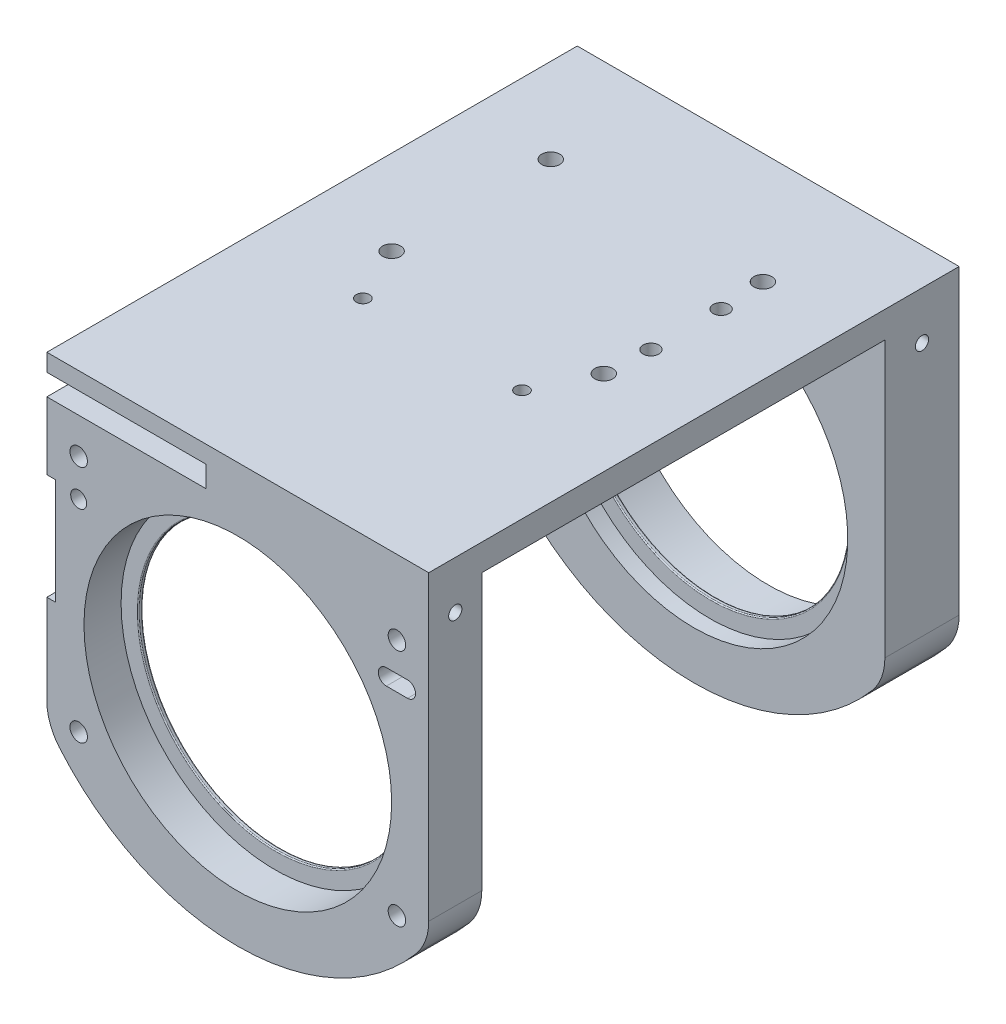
ISO-10303-21;
HEADER;
FILE_DESCRIPTION(('STEP AP214'),'2;1');
FILE_NAME('part.step','',(''),(''),'','','');
FILE_SCHEMA(('AUTOMOTIVE_DESIGN { 1 0 10303 214 1 1 1 1 }'));
ENDSEC;
DATA;
#1=APPLICATION_CONTEXT('core data for automotive mechanical design processes');
#2=APPLICATION_PROTOCOL_DEFINITION('international standard','automotive_design',2000,#1);
#3=PRODUCT_CONTEXT('',#1,'mechanical');
#4=PRODUCT('Part','Part','',(#3));
#5=PRODUCT_RELATED_PRODUCT_CATEGORY('part','',(#4));
#6=PRODUCT_DEFINITION_FORMATION('','',#4);
#7=PRODUCT_DEFINITION_CONTEXT('part definition',#1,'design');
#8=PRODUCT_DEFINITION('design','',#6,#7);
#9=PRODUCT_DEFINITION_SHAPE('','',#8);
#10=(LENGTH_UNIT() NAMED_UNIT(*) SI_UNIT(.MILLI.,.METRE.));
#11=(NAMED_UNIT(*) PLANE_ANGLE_UNIT() SI_UNIT($,.RADIAN.));
#12=(NAMED_UNIT(*) SI_UNIT($,.STERADIAN.) SOLID_ANGLE_UNIT());
#13=UNCERTAINTY_MEASURE_WITH_UNIT(LENGTH_MEASURE(1.E-05),#10,'distance_accuracy_value','');
#14=(GEOMETRIC_REPRESENTATION_CONTEXT(3) GLOBAL_UNCERTAINTY_ASSIGNED_CONTEXT((#13)) GLOBAL_UNIT_ASSIGNED_CONTEXT((#10,
#11,#12)) REPRESENTATION_CONTEXT('',''));
#15=CARTESIAN_POINT('',(0.,0.,0.));
#16=DIRECTION('',(0.,0.,1.));
#17=DIRECTION('',(1.,0.,0.));
#18=AXIS2_PLACEMENT_3D('',#15,#16,#17);
#19=CARTESIAN_POINT('',(0.,-41.,92.2075000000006));
#20=DIRECTION('',(0.,0.,-1.));
#21=DIRECTION('',(0.,1.,0.));
#22=AXIS2_PLACEMENT_3D('',#19,#20,#21);
#23=TOROIDAL_SURFACE('',#22,26.1575000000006,0.19750000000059);
#24=CARTESIAN_POINT('',(0.,-41.,92.2075000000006));
#25=DIRECTION('',(0.,0.,-1.));
#26=DIRECTION('',(0.,1.,0.));
#27=AXIS2_PLACEMENT_3D('',#24,#25,#26);
#28=CIRCLE('',#27,25.96);
#29=CARTESIAN_POINT('',(25.5656092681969,-45.5079066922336,92.2075000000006));
#30=VERTEX_POINT('',#29);
#31=CARTESIAN_POINT('',(25.5656092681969,-36.4920933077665,92.2075000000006));
#32=VERTEX_POINT('',#31);
#33=EDGE_CURVE('P0_E166',#30,#32,#28,.T.);
#34=ORIENTED_EDGE('',*,*,#33,.F.);
#35=CARTESIAN_POINT('',(25.7601087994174,-45.5422022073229,92.2075000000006));
#36=DIRECTION('',(-0.173648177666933,-0.984807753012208,0.));
#37=DIRECTION('',(-0.984807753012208,0.173648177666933,0.));
#38=AXIS2_PLACEMENT_3D('',#35,#36,#37);
#39=CIRCLE('',#38,0.19750000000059);
#40=CARTESIAN_POINT('',(25.7601087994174,-45.5422022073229,92.01));
#41=VERTEX_POINT('',#40);
#42=EDGE_CURVE('P0_E202',#30,#41,#39,.T.);
#43=ORIENTED_EDGE('',*,*,#42,.T.);
#44=CARTESIAN_POINT('',(0.,-41.,92.01));
#45=DIRECTION('',(0.,0.,-1.));
#46=DIRECTION('',(0.,1.,0.));
#47=AXIS2_PLACEMENT_3D('',#44,#45,#46);
#48=CIRCLE('',#47,26.1575000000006);
#49=CARTESIAN_POINT('',(25.7601087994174,-36.4577977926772,92.01));
#50=VERTEX_POINT('',#49);
#51=EDGE_CURVE('P0_E191',#41,#50,#48,.T.);
#52=ORIENTED_EDGE('',*,*,#51,.T.);
#53=CARTESIAN_POINT('',(25.7601087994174,-36.4577977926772,92.2075000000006));
#54=DIRECTION('',(-0.173648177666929,0.984807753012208,0.));
#55=DIRECTION('',(0.984807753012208,0.173648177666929,0.));
#56=AXIS2_PLACEMENT_3D('',#53,#54,#55);
#57=CIRCLE('',#56,0.19750000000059);
#58=EDGE_CURVE('P0_E37',#50,#32,#57,.T.);
#59=ORIENTED_EDGE('',*,*,#58,.T.);
#60=EDGE_LOOP('',(#34,#43,#52,#59));
#61=FACE_BOUND('',#60,.T.);
#62=ADVANCED_FACE('P0_F16',(#61),#23,.T.);
#63=CARTESIAN_POINT('',(0.,-41.,93.195));
#64=DIRECTION('',(0.,0.,-1.));
#65=DIRECTION('',(0.,1.,0.));
#66=AXIS2_PLACEMENT_3D('',#63,#64,#65);
#67=CYLINDRICAL_SURFACE('',#66,25.96);
#68=CARTESIAN_POINT('',(0.,-41.,92.6024999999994));
#69=DIRECTION('',(0.,0.,-1.));
#70=DIRECTION('',(0.,1.,0.));
#71=AXIS2_PLACEMENT_3D('',#68,#69,#70);
#72=CIRCLE('',#71,25.96);
#73=CARTESIAN_POINT('',(25.5656092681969,-45.5079066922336,92.6024999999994));
#74=VERTEX_POINT('',#73);
#75=CARTESIAN_POINT('',(25.5656092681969,-36.4920933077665,92.6024999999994));
#76=VERTEX_POINT('',#75);
#77=EDGE_CURVE('P0_E161',#74,#76,#72,.T.);
#78=ORIENTED_EDGE('',*,*,#77,.F.);
#79=DIRECTION('',(0.,0.,-1.));
#80=VECTOR('',#79,1.);
#81=CARTESIAN_POINT('',(25.5656092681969,-45.5079066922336,93.195));
#82=LINE('',#81,#80);
#83=EDGE_CURVE('P0_E163',#74,#30,#82,.T.);
#84=ORIENTED_EDGE('',*,*,#83,.T.);
#85=ORIENTED_EDGE('',*,*,#33,.T.);
#86=DIRECTION('',(0.,0.,-1.));
#87=VECTOR('',#86,1.);
#88=CARTESIAN_POINT('',(25.5656092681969,-36.4920933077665,93.195));
#89=LINE('',#88,#87);
#90=EDGE_CURVE('P0_E113',#32,#76,#89,.F.);
#91=ORIENTED_EDGE('',*,*,#90,.T.);
#92=EDGE_LOOP('',(#78,#84,#85,#91));
#93=FACE_BOUND('',#92,.T.);
#94=ADVANCED_FACE('P0_F148',(#93),#67,.F.);
#95=CARTESIAN_POINT('',(0.,-41.,92.6024999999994));
#96=DIRECTION('',(0.,0.,-1.));
#97=DIRECTION('',(0.,1.,0.));
#98=AXIS2_PLACEMENT_3D('',#95,#96,#97);
#99=TOROIDAL_SURFACE('',#98,26.1575000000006,0.19750000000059);
#100=CARTESIAN_POINT('',(0.,-41.,92.8));
#101=DIRECTION('',(0.,0.,-1.));
#102=DIRECTION('',(0.,1.,0.));
#103=AXIS2_PLACEMENT_3D('',#100,#101,#102);
#104=CIRCLE('',#103,26.1575000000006);
#105=CARTESIAN_POINT('',(25.7601087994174,-45.5422022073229,92.8));
#106=VERTEX_POINT('',#105);
#107=CARTESIAN_POINT('',(25.7601087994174,-36.4577977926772,92.8));
#108=VERTEX_POINT('',#107);
#109=EDGE_CURVE('P0_E106',#106,#108,#104,.T.);
#110=ORIENTED_EDGE('',*,*,#109,.F.);
#111=CARTESIAN_POINT('',(25.7601087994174,-45.5422022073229,92.6024999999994));
#112=DIRECTION('',(-0.173648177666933,-0.984807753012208,0.));
#113=DIRECTION('',(-0.984807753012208,0.173648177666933,0.));
#114=AXIS2_PLACEMENT_3D('',#111,#112,#113);
#115=CIRCLE('',#114,0.19750000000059);
#116=EDGE_CURVE('P0_E198',#106,#74,#115,.T.);
#117=ORIENTED_EDGE('',*,*,#116,.T.);
#118=ORIENTED_EDGE('',*,*,#77,.T.);
#119=CARTESIAN_POINT('',(25.7601087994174,-36.4577977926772,92.6024999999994));
#120=DIRECTION('',(-0.173648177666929,0.984807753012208,0.));
#121=DIRECTION('',(0.984807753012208,0.173648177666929,0.));
#122=AXIS2_PLACEMENT_3D('',#119,#120,#121);
#123=CIRCLE('',#122,0.19750000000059);
#124=EDGE_CURVE('P0_E108',#76,#108,#123,.T.);
#125=ORIENTED_EDGE('',*,*,#124,.T.);
#126=EDGE_LOOP('',(#110,#117,#118,#125));
#127=FACE_BOUND('',#126,.T.);
#128=ADVANCED_FACE('P0_F146',(#127),#99,.T.);
#129=CARTESIAN_POINT('',(26.1575000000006,-41.,92.8));
#130=DIRECTION('',(0.,0.,-1.));
#131=DIRECTION('',(0.,1.,0.));
#132=AXIS2_PLACEMENT_3D('',#129,#130,#131);
#133=PLANE('',#132);
#134=CARTESIAN_POINT('',(0.,-41.,92.8));
#135=DIRECTION('',(0.,0.,-1.));
#136=DIRECTION('',(0.,1.,0.));
#137=AXIS2_PLACEMENT_3D('',#134,#135,#136);
#138=CIRCLE('',#137,29.7724999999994);
#139=CARTESIAN_POINT('',(29.3201888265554,-46.1699403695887,92.8));
#140=VERTEX_POINT('',#139);
#141=CARTESIAN_POINT('',(28.221857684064,-31.516935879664,92.8));
#142=VERTEX_POINT('',#141);
#143=EDGE_CURVE('P0_E169',#140,#142,#138,.T.);
#144=ORIENTED_EDGE('',*,*,#143,.F.);
#145=DIRECTION('',(-0.984807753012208,0.173648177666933,0.));
#146=VECTOR('',#145,1.);
#147=CARTESIAN_POINT('',(25.3687548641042,-45.4731959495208,92.8));
#148=LINE('',#147,#146);
#149=EDGE_CURVE('P0_E197',#140,#106,#148,.T.);
#150=ORIENTED_EDGE('',*,*,#149,.T.);
#151=ORIENTED_EDGE('',*,*,#109,.T.);
#152=DIRECTION('',(0.984807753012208,0.173648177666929,0.));
#153=VECTOR('',#152,1.);
#154=CARTESIAN_POINT('',(25.3687548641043,-36.5268040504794,92.8));
#155=LINE('',#154,#153);
#156=CARTESIAN_POINT('',(27.211058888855,-36.201956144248,92.8));
#157=VERTEX_POINT('',#156);
#158=EDGE_CURVE('P0_E98',#108,#157,#155,.T.);
#159=ORIENTED_EDGE('',*,*,#158,.T.);
#160=CARTESIAN_POINT('',(33.4637674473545,-35.0994349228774,92.8));
#161=DIRECTION('',(0.,0.,-1.));
#162=DIRECTION('',(0.,1.,0.));
#163=AXIS2_PLACEMENT_3D('',#160,#161,#162);
#164=CIRCLE('',#163,6.34916666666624);
#165=EDGE_CURVE('P0_E85',#157,#142,#164,.T.);
#166=ORIENTED_EDGE('',*,*,#165,.T.);
#167=EDGE_LOOP('',(#144,#150,#151,#159,#166));
#168=FACE_BOUND('',#167,.T.);
#169=ADVANCED_FACE('P0_F103',(#168),#133,.F.);
#170=CARTESIAN_POINT('',(0.,-41.,92.6024999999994));
#171=DIRECTION('',(0.,0.,-1.));
#172=DIRECTION('',(0.,1.,0.));
#173=AXIS2_PLACEMENT_3D('',#170,#171,#172);
#174=TOROIDAL_SURFACE('',#173,29.7724999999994,0.19750000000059);
#175=CARTESIAN_POINT('',(0.,-41.,92.6024999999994));
#176=DIRECTION('',(0.,0.,-1.));
#177=DIRECTION('',(0.,1.,0.));
#178=AXIS2_PLACEMENT_3D('',#175,#176,#177);
#179=CIRCLE('',#178,29.97);
#180=CARTESIAN_POINT('',(29.5146883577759,-46.204235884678,92.6024999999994));
#181=VERTEX_POINT('',#180);
#182=CARTESIAN_POINT('',(28.36315960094,-31.3184671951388,92.6024999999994));
#183=VERTEX_POINT('',#182);
#184=EDGE_CURVE('P0_E187',#181,#183,#179,.T.);
#185=ORIENTED_EDGE('',*,*,#184,.F.);
#186=CARTESIAN_POINT('',(29.3201888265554,-46.1699403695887,92.6024999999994));
#187=DIRECTION('',(-0.173648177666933,-0.984807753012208,0.));
#188=DIRECTION('',(-0.984807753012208,0.173648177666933,0.));
#189=AXIS2_PLACEMENT_3D('',#186,#187,#188);
#190=CIRCLE('',#189,0.19750000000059);
#191=EDGE_CURVE('P0_E196',#181,#140,#190,.T.);
#192=ORIENTED_EDGE('',*,*,#191,.T.);
#193=ORIENTED_EDGE('',*,*,#143,.T.);
#194=CARTESIAN_POINT('',(28.0838847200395,-31.7276728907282,92.6022999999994));
#195=CARTESIAN_POINT('',(28.0838684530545,-31.7277000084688,92.6116521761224));
#196=CARTESIAN_POINT('',(28.0843291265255,-31.7269637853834,92.6209868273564));
#197=CARTESIAN_POINT('',(28.0861213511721,-31.7241061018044,92.6392891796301));
#198=CARTESIAN_POINT('',(28.0874466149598,-31.7219946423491,92.648259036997));
#199=CARTESIAN_POINT('',(28.0908834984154,-31.7165300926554,92.6656242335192));
#200=CARTESIAN_POINT('',(28.0929935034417,-31.7131795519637,92.6740207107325));
#201=CARTESIAN_POINT('',(28.0978890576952,-31.7054273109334,92.6901115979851));
#202=CARTESIAN_POINT('',(28.1006758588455,-31.7010236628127,92.697804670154));
#203=CARTESIAN_POINT('',(28.1078241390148,-31.689765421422,92.7147873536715));
#204=CARTESIAN_POINT('',(28.1124019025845,-31.682581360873,92.7237676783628));
#205=CARTESIAN_POINT('',(28.1223179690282,-31.6671004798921,92.7402216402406));
#206=CARTESIAN_POINT('',(28.1276574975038,-31.6588018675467,92.7476928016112));
#207=CARTESIAN_POINT('',(28.1403653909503,-31.6391636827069,92.7628580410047));
#208=CARTESIAN_POINT('',(28.1479015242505,-31.6275923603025,92.7701110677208));
#209=CARTESIAN_POINT('',(28.1635971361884,-31.6036778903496,92.7822653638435));
#210=CARTESIAN_POINT('',(28.1717569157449,-31.5913343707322,92.7871654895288));
#211=CARTESIAN_POINT('',(28.1885770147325,-31.5660915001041,92.7946958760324));
#212=CARTESIAN_POINT('',(28.1972419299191,-31.5531874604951,92.7973000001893));
#213=CARTESIAN_POINT('',(28.2147916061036,-31.5272625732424,92.8001445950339));
#214=CARTESIAN_POINT('',(28.2236764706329,-31.5142416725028,92.8003839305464));
#215=CARTESIAN_POINT('',(28.2424259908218,-31.4869824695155,92.798350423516));
#216=CARTESIAN_POINT('',(28.252292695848,-31.4727647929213,92.7958031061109));
#217=CARTESIAN_POINT('',(28.2717183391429,-31.4450089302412,92.7876430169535));
#218=CARTESIAN_POINT('',(28.2812775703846,-31.4314700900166,92.7820332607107));
#219=CARTESIAN_POINT('',(28.2973115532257,-31.4089347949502,92.7694880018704));
#220=CARTESIAN_POINT('',(28.3039505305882,-31.3996613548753,92.7632570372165));
#221=CARTESIAN_POINT('',(28.3165926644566,-31.3820937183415,92.7490236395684));
#222=CARTESIAN_POINT('',(28.3225967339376,-31.3737981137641,92.7410238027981));
#223=CARTESIAN_POINT('',(28.3327787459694,-31.3597912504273,92.7247678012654));
#224=CARTESIAN_POINT('',(28.3370945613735,-31.3538794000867,92.7167713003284));
#225=CARTESIAN_POINT('',(28.3449079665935,-31.3432082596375,92.6996705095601));
#226=CARTESIAN_POINT('',(28.3484054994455,-31.3384490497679,92.6905661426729));
#227=CARTESIAN_POINT('',(28.3544107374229,-31.3302947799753,92.6713707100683));
#228=CARTESIAN_POINT('',(28.3569109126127,-31.3269100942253,92.6612728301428));
#229=CARTESIAN_POINT('',(28.360708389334,-31.3217747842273,92.6404641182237));
#230=CARTESIAN_POINT('',(28.3620087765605,-31.3200199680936,92.6297549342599));
#231=CARTESIAN_POINT('',(28.3628304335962,-31.3189112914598,92.6161870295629));
#232=CARTESIAN_POINT('',(28.3629556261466,-31.3187423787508,92.6134118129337));
#233=CARTESIAN_POINT('',(28.3631210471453,-31.3185191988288,92.6078581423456));
#234=CARTESIAN_POINT('',(28.3631613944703,-31.3184647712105,92.6050796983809));
#235=CARTESIAN_POINT('',(28.3631595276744,-31.3184672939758,92.6022999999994));
#236=B_SPLINE_CURVE_WITH_KNOTS('',3,(#194,#195,#196,#197,#198,#199,#200,#201,#202,#203,#204,
#205,#206,#207,#208,#209,#210,#211,#212,#213,#214,#215,#216,#217,#218,#219,#220,#221,#222,#223,
#224,#225,#226,#227,#228,#229,#230,#231,#232,#233,#234,#235),.UNSPECIFIED.,.F.,.F.,(4,2,2,2,2,2,
2,2,2,2,2,2,2,2,2,2,2,2,2,2,4),(0.,0.0279855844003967,0.0557698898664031,0.0834973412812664,
0.111276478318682,0.148209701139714,0.185203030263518,0.231753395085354,0.278326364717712,
0.325422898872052,0.372542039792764,0.424756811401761,0.476920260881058,0.515760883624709,
0.554544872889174,0.586935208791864,0.619327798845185,0.651960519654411,0.68450907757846,
0.692856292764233,0.701191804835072),.UNSPECIFIED.);
#237=EDGE_CURVE('P0_E91',#142,#183,#236,.T.);
#238=ORIENTED_EDGE('',*,*,#237,.T.);
#239=EDGE_LOOP('',(#185,#192,#193,#238));
#240=FACE_BOUND('',#239,.T.);
#241=ADVANCED_FACE('P0_F138',(#240),#174,.T.);
#242=CARTESIAN_POINT('',(0.,-41.,93.195));
#243=DIRECTION('',(0.,0.,-1.));
#244=DIRECTION('',(0.,1.,0.));
#245=AXIS2_PLACEMENT_3D('',#242,#243,#244);
#246=CYLINDRICAL_SURFACE('',#245,29.97);
#247=CARTESIAN_POINT('',(0.,-41.,92.2075000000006));
#248=DIRECTION('',(0.,0.,-1.));
#249=DIRECTION('',(0.,1.,0.));
#250=AXIS2_PLACEMENT_3D('',#247,#248,#249);
#251=CIRCLE('',#250,29.97);
#252=CARTESIAN_POINT('',(29.5146883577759,-46.204235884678,92.2075000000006));
#253=VERTEX_POINT('',#252);
#254=CARTESIAN_POINT('',(28.36315960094,-31.3184671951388,92.2075000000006));
#255=VERTEX_POINT('',#254);
#256=EDGE_CURVE('P0_E184',#253,#255,#251,.T.);
#257=ORIENTED_EDGE('',*,*,#256,.F.);
#258=DIRECTION('',(0.,0.,-1.));
#259=VECTOR('',#258,1.);
#260=CARTESIAN_POINT('',(29.5146883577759,-46.204235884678,93.195));
#261=LINE('',#260,#259);
#262=EDGE_CURVE('P0_E208',#253,#181,#261,.F.);
#263=ORIENTED_EDGE('',*,*,#262,.T.);
#264=ORIENTED_EDGE('',*,*,#184,.T.);
#265=DIRECTION('',(0.,0.,-1.));
#266=VECTOR('',#265,1.);
#267=CARTESIAN_POINT('',(28.36315960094,-31.3184671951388,92.405));
#268=LINE('',#267,#266);
#269=EDGE_CURVE('P0_E111',#183,#255,#268,.T.);
#270=ORIENTED_EDGE('',*,*,#269,.T.);
#271=EDGE_LOOP('',(#257,#263,#264,#270));
#272=FACE_BOUND('',#271,.T.);
#273=ADVANCED_FACE('P0_F142',(#272),#246,.T.);
#274=CARTESIAN_POINT('',(0.,-41.,92.2075000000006));
#275=DIRECTION('',(0.,0.,-1.));
#276=DIRECTION('',(0.,1.,0.));
#277=AXIS2_PLACEMENT_3D('',#274,#275,#276);
#278=TOROIDAL_SURFACE('',#277,29.7724999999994,0.19750000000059);
#279=CARTESIAN_POINT('',(0.,-41.,92.01));
#280=DIRECTION('',(0.,0.,-1.));
#281=DIRECTION('',(0.,1.,0.));
#282=AXIS2_PLACEMENT_3D('',#279,#280,#281);
#283=CIRCLE('',#282,29.7724999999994);
#284=CARTESIAN_POINT('',(29.3201888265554,-46.1699403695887,92.01));
#285=VERTEX_POINT('',#284);
#286=CARTESIAN_POINT('',(28.221857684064,-31.516935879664,92.01));
#287=VERTEX_POINT('',#286);
#288=EDGE_CURVE('P0_E179',#285,#287,#283,.T.);
#289=ORIENTED_EDGE('',*,*,#288,.F.);
#290=CARTESIAN_POINT('',(29.3201888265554,-46.1699403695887,92.2075000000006));
#291=DIRECTION('',(-0.173648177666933,-0.984807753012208,0.));
#292=DIRECTION('',(-0.984807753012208,0.173648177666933,0.));
#293=AXIS2_PLACEMENT_3D('',#290,#291,#292);
#294=CIRCLE('',#293,0.19750000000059);
#295=EDGE_CURVE('P0_E30',#285,#253,#294,.T.);
#296=ORIENTED_EDGE('',*,*,#295,.T.);
#297=ORIENTED_EDGE('',*,*,#256,.T.);
#298=CARTESIAN_POINT('',(28.3631595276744,-31.3184672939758,92.2077000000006));
#299=CARTESIAN_POINT('',(28.3631768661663,-31.3184449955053,92.1980091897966));
#300=CARTESIAN_POINT('',(28.362658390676,-31.3191433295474,92.1883305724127));
#301=CARTESIAN_POINT('',(28.3606330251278,-31.321877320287,92.1693198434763));
#302=CARTESIAN_POINT('',(28.3591312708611,-31.3239060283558,92.1599861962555));
#303=CARTESIAN_POINT('',(28.3552234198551,-31.3291954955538,92.1418921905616));
#304=CARTESIAN_POINT('',(28.352818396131,-31.3324547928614,92.1331311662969));
#305=CARTESIAN_POINT('',(28.3472277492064,-31.3400518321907,92.1163530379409));
#306=CARTESIAN_POINT('',(28.3440413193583,-31.3443906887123,92.1083367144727));
#307=CARTESIAN_POINT('',(28.3368099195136,-31.3542695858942,92.0927219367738));
#308=CARTESIAN_POINT('',(28.3327245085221,-31.3598666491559,92.0851785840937));
#309=CARTESIAN_POINT('',(28.3239850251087,-31.3718875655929,92.071161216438));
#310=CARTESIAN_POINT('',(28.3193307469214,-31.3783117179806,92.0646875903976));
#311=CARTESIAN_POINT('',(28.3087792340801,-31.3929395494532,92.0518504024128));
#312=CARTESIAN_POINT('',(28.3028042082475,-31.4012612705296,92.0456856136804));
#313=CARTESIAN_POINT('',(28.2904567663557,-31.4185536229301,92.0348500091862));
#314=CARTESIAN_POINT('',(28.2840841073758,-31.4275246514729,92.0301801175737));
#315=CARTESIAN_POINT('',(28.2698697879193,-31.4476513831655,92.0215635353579));
#316=CARTESIAN_POINT('',(28.2619773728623,-31.4589004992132,92.0179183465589));
#317=CARTESIAN_POINT('',(28.2460517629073,-31.4817623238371,92.0126339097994));
#318=CARTESIAN_POINT('',(28.2380184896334,-31.493375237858,92.0109958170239));
#319=CARTESIAN_POINT('',(28.2207027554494,-31.5185887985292,92.0095696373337));
#320=CARTESIAN_POINT('',(28.2114245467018,-31.53221219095,92.0101167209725));
#321=CARTESIAN_POINT('',(28.1931261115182,-31.5593042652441,92.013797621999));
#322=CARTESIAN_POINT('',(28.1841062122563,-31.5727727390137,92.0169345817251));
#323=CARTESIAN_POINT('',(28.1660425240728,-31.5999621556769,92.0260706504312));
#324=CARTESIAN_POINT('',(28.1570290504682,-31.6136506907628,92.0322284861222));
#325=CARTESIAN_POINT('',(28.139896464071,-31.6398744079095,92.0475243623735));
#326=CARTESIAN_POINT('',(28.1317754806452,-31.6524119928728,92.0566560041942));
#327=CARTESIAN_POINT('',(28.1194547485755,-31.6715607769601,92.0742407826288));
#328=CARTESIAN_POINT('',(28.1148713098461,-31.6787201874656,92.081832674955));
#329=CARTESIAN_POINT('',(28.1064397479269,-31.6919404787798,92.0982793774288));
#330=CARTESIAN_POINT('',(28.1025905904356,-31.6980029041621,92.1071323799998));
#331=CARTESIAN_POINT('',(28.0963806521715,-31.7078122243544,92.1244375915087));
#332=CARTESIAN_POINT('',(28.0938791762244,-31.7117759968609,92.1327159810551));
#333=CARTESIAN_POINT('',(28.0896511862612,-31.7184871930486,92.149932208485));
#334=CARTESIAN_POINT('',(28.0879232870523,-31.7212367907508,92.1588688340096));
#335=CARTESIAN_POINT('',(28.085725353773,-31.7247373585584,92.1744796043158));
#336=CARTESIAN_POINT('',(28.0850348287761,-31.7258383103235,92.1810460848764));
#337=CARTESIAN_POINT('',(28.0841104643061,-31.7273126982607,92.1943063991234));
#338=CARTESIAN_POINT('',(28.0838776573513,-31.7276844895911,92.2010004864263));
#339=CARTESIAN_POINT('',(28.0838847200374,-31.7276728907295,92.2077));
#340=B_SPLINE_CURVE_WITH_KNOTS('',3,(#298,#299,#300,#301,#302,#303,#304,#305,#306,#307,#308,
#309,#310,#311,#312,#313,#314,#315,#316,#317,#318,#319,#320,#321,#322,#323,#324,#325,#326,#327,
#328,#329,#330,#331,#332,#333,#334,#335,#336,#337,#338,#339),.UNSPECIFIED.,.F.,.F.,(4,2,2,2,2,2,
2,2,2,2,2,2,2,2,2,2,2,2,2,2,4),(0.,0.0290115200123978,0.0578727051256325,0.0866997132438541,
0.115556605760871,0.146169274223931,0.176793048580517,0.212528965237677,0.248286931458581,
0.290774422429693,0.3332863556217,0.382550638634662,0.431874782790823,0.484124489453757,
0.536262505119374,0.570334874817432,0.604358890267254,0.632783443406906,0.661156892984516,
0.681184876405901,0.701257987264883),.UNSPECIFIED.);
#341=EDGE_CURVE('P0_E107',#255,#287,#340,.T.);
#342=ORIENTED_EDGE('',*,*,#341,.T.);
#343=EDGE_LOOP('',(#289,#296,#297,#342));
#344=FACE_BOUND('',#343,.T.);
#345=ADVANCED_FACE('P0_F123',(#344),#278,.T.);
#346=CARTESIAN_POINT('',(29.7724999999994,-41.,92.01));
#347=DIRECTION('',(0.,0.,1.));
#348=DIRECTION('',(0.,-1.,0.));
#349=AXIS2_PLACEMENT_3D('',#346,#347,#348);
#350=PLANE('',#349);
#351=ORIENTED_EDGE('',*,*,#51,.F.);
#352=DIRECTION('',(0.984807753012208,-0.173648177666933,0.));
#353=VECTOR('',#352,1.);
#354=CARTESIAN_POINT('',(28.8747492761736,-46.0913973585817,92.01));
#355=LINE('',#354,#353);
#356=EDGE_CURVE('P0_E11',#41,#285,#355,.T.);
#357=ORIENTED_EDGE('',*,*,#356,.T.);
#358=ORIENTED_EDGE('',*,*,#288,.T.);
#359=CARTESIAN_POINT('',(33.4637674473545,-35.0994349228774,92.01));
#360=DIRECTION('',(0.,0.,1.));
#361=DIRECTION('',(0.,-1.,0.));
#362=AXIS2_PLACEMENT_3D('',#359,#360,#361);
#363=CIRCLE('',#362,6.34916666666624);
#364=CARTESIAN_POINT('',(27.211058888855,-36.201956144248,92.01));
#365=VERTEX_POINT('',#364);
#366=EDGE_CURVE('P0_E23',#287,#365,#363,.T.);
#367=ORIENTED_EDGE('',*,*,#366,.T.);
#368=DIRECTION('',(-0.984807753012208,-0.173648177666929,0.));
#369=VECTOR('',#368,1.);
#370=CARTESIAN_POINT('',(28.8747492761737,-35.9086026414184,92.01));
#371=LINE('',#370,#369);
#372=EDGE_CURVE('P0_E100',#365,#50,#371,.T.);
#373=ORIENTED_EDGE('',*,*,#372,.T.);
#374=EDGE_LOOP('',(#351,#357,#358,#367,#373));
#375=FACE_BOUND('',#374,.T.);
#376=ADVANCED_FACE('P0_F176',(#375),#350,.F.);
#377=CARTESIAN_POINT('',(0.,-41.,93.195));
#378=DIRECTION('',(-0.173648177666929,0.984807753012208,0.));
#379=DIRECTION('',(0.984807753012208,0.173648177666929,0.));
#380=AXIS2_PLACEMENT_3D('',#377,#378,#379);
#381=PLANE('',#380);
#382=ORIENTED_EDGE('',*,*,#124,.F.);
#383=ORIENTED_EDGE('',*,*,#90,.F.);
#384=ORIENTED_EDGE('',*,*,#58,.F.);
#385=ORIENTED_EDGE('',*,*,#372,.F.);
#386=DIRECTION('',(0.,0.,-1.));
#387=VECTOR('',#386,1.);
#388=CARTESIAN_POINT('',(27.211058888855,-36.201956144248,93.195));
#389=LINE('',#388,#387);
#390=EDGE_CURVE('P0_E88',#157,#365,#389,.T.);
#391=ORIENTED_EDGE('',*,*,#390,.F.);
#392=ORIENTED_EDGE('',*,*,#158,.F.);
#393=EDGE_LOOP('',(#382,#383,#384,#385,#391,#392));
#394=FACE_BOUND('',#393,.T.);
#395=ADVANCED_FACE('P0_F97',(#394),#381,.F.);
#396=CARTESIAN_POINT('',(33.4637674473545,-35.0994349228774,93.195));
#397=DIRECTION('',(0.,0.,-1.));
#398=DIRECTION('',(0.,1.,0.));
#399=AXIS2_PLACEMENT_3D('',#396,#397,#398);
#400=CYLINDRICAL_SURFACE('',#399,6.34916666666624);
#401=ORIENTED_EDGE('',*,*,#390,.T.);
#402=ORIENTED_EDGE('',*,*,#366,.F.);
#403=ORIENTED_EDGE('',*,*,#341,.F.);
#404=ORIENTED_EDGE('',*,*,#269,.F.);
#405=ORIENTED_EDGE('',*,*,#237,.F.);
#406=ORIENTED_EDGE('',*,*,#165,.F.);
#407=EDGE_LOOP('',(#401,#402,#403,#404,#405,#406));
#408=FACE_BOUND('',#407,.T.);
#409=ADVANCED_FACE('P0_F87',(#408),#400,.F.);
#410=CARTESIAN_POINT('',(32.466157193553,-46.7246594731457,93.195));
#411=DIRECTION('',(-0.173648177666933,-0.984807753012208,0.));
#412=DIRECTION('',(-0.984807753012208,0.173648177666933,0.));
#413=AXIS2_PLACEMENT_3D('',#410,#411,#412);
#414=PLANE('',#413);
#415=ORIENTED_EDGE('',*,*,#83,.F.);
#416=ORIENTED_EDGE('',*,*,#116,.F.);
#417=ORIENTED_EDGE('',*,*,#149,.F.);
#418=ORIENTED_EDGE('',*,*,#191,.F.);
#419=ORIENTED_EDGE('',*,*,#262,.F.);
#420=ORIENTED_EDGE('',*,*,#295,.F.);
#421=ORIENTED_EDGE('',*,*,#356,.F.);
#422=ORIENTED_EDGE('',*,*,#42,.F.);
#423=EDGE_LOOP('',(#415,#416,#417,#418,#419,#420,#421,#422));
#424=FACE_BOUND('',#423,.T.);
#425=ADVANCED_FACE('P0_F130',(#424),#414,.F.);
#426=CLOSED_SHELL('',(#62,#94,#128,#169,#241,#273,#345,#376,#395,#409,#425));
#427=MANIFOLD_SOLID_BREP('P0_B1',#426);
#428=CARTESIAN_POINT('',(0.,-41.,10.1975000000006));
#429=DIRECTION('',(0.,0.,-1.));
#430=DIRECTION('',(0.,1.,0.));
#431=AXIS2_PLACEMENT_3D('',#428,#429,#430);
#432=TOROIDAL_SURFACE('',#431,26.1575000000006,0.19750000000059);
#433=CARTESIAN_POINT('',(0.,-41.,10.1975000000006));
#434=DIRECTION('',(0.,0.,-1.));
#435=DIRECTION('',(0.,1.,0.));
#436=AXIS2_PLACEMENT_3D('',#433,#434,#435);
#437=CIRCLE('',#436,25.96);
#438=CARTESIAN_POINT('',(25.5656092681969,-45.5079066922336,10.1975000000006));
#439=VERTEX_POINT('',#438);
#440=CARTESIAN_POINT('',(25.5656092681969,-36.4920933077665,10.1975000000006));
#441=VERTEX_POINT('',#440);
#442=EDGE_CURVE('P1_E166',#439,#441,#437,.T.);
#443=ORIENTED_EDGE('',*,*,#442,.F.);
#444=CARTESIAN_POINT('',(25.7601087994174,-45.5422022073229,10.1975000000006));
#445=DIRECTION('',(-0.173648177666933,-0.984807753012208,0.));
#446=DIRECTION('',(-0.984807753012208,0.173648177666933,0.));
#447=AXIS2_PLACEMENT_3D('',#444,#445,#446);
#448=CIRCLE('',#447,0.19750000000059);
#449=CARTESIAN_POINT('',(25.7601087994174,-45.5422022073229,9.99999999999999));
#450=VERTEX_POINT('',#449);
#451=EDGE_CURVE('P1_E202',#439,#450,#448,.T.);
#452=ORIENTED_EDGE('',*,*,#451,.T.);
#453=CARTESIAN_POINT('',(0.,-41.,9.99999999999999));
#454=DIRECTION('',(0.,0.,-1.));
#455=DIRECTION('',(0.,1.,0.));
#456=AXIS2_PLACEMENT_3D('',#453,#454,#455);
#457=CIRCLE('',#456,26.1575000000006);
#458=CARTESIAN_POINT('',(25.7601087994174,-36.4577977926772,9.99999999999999));
#459=VERTEX_POINT('',#458);
#460=EDGE_CURVE('P1_E191',#450,#459,#457,.T.);
#461=ORIENTED_EDGE('',*,*,#460,.T.);
#462=CARTESIAN_POINT('',(25.7601087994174,-36.4577977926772,10.1975000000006));
#463=DIRECTION('',(-0.173648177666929,0.984807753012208,0.));
#464=DIRECTION('',(0.984807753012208,0.173648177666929,0.));
#465=AXIS2_PLACEMENT_3D('',#462,#463,#464);
#466=CIRCLE('',#465,0.19750000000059);
#467=EDGE_CURVE('P1_E37',#459,#441,#466,.T.);
#468=ORIENTED_EDGE('',*,*,#467,.T.);
#469=EDGE_LOOP('',(#443,#452,#461,#468));
#470=FACE_BOUND('',#469,.T.);
#471=ADVANCED_FACE('P1_F16',(#470),#432,.T.);
#472=CARTESIAN_POINT('',(0.,-41.,11.185));
#473=DIRECTION('',(0.,0.,-1.));
#474=DIRECTION('',(0.,1.,0.));
#475=AXIS2_PLACEMENT_3D('',#472,#473,#474);
#476=CYLINDRICAL_SURFACE('',#475,25.96);
#477=CARTESIAN_POINT('',(0.,-41.,10.5924999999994));
#478=DIRECTION('',(0.,0.,-1.));
#479=DIRECTION('',(0.,1.,0.));
#480=AXIS2_PLACEMENT_3D('',#477,#478,#479);
#481=CIRCLE('',#480,25.96);
#482=CARTESIAN_POINT('',(25.5656092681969,-45.5079066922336,10.5924999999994));
#483=VERTEX_POINT('',#482);
#484=CARTESIAN_POINT('',(25.5656092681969,-36.4920933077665,10.5924999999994));
#485=VERTEX_POINT('',#484);
#486=EDGE_CURVE('P1_E161',#483,#485,#481,.T.);
#487=ORIENTED_EDGE('',*,*,#486,.F.);
#488=DIRECTION('',(0.,0.,-1.));
#489=VECTOR('',#488,1.);
#490=CARTESIAN_POINT('',(25.5656092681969,-45.5079066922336,11.185));
#491=LINE('',#490,#489);
#492=EDGE_CURVE('P1_E163',#483,#439,#491,.T.);
#493=ORIENTED_EDGE('',*,*,#492,.T.);
#494=ORIENTED_EDGE('',*,*,#442,.T.);
#495=DIRECTION('',(0.,0.,-1.));
#496=VECTOR('',#495,1.);
#497=CARTESIAN_POINT('',(25.5656092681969,-36.4920933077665,11.185));
#498=LINE('',#497,#496);
#499=EDGE_CURVE('P1_E113',#441,#485,#498,.F.);
#500=ORIENTED_EDGE('',*,*,#499,.T.);
#501=EDGE_LOOP('',(#487,#493,#494,#500));
#502=FACE_BOUND('',#501,.T.);
#503=ADVANCED_FACE('P1_F148',(#502),#476,.F.);
#504=CARTESIAN_POINT('',(0.,-41.,10.5924999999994));
#505=DIRECTION('',(0.,0.,-1.));
#506=DIRECTION('',(0.,1.,0.));
#507=AXIS2_PLACEMENT_3D('',#504,#505,#506);
#508=TOROIDAL_SURFACE('',#507,26.1575000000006,0.19750000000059);
#509=CARTESIAN_POINT('',(0.,-41.,10.79));
#510=DIRECTION('',(0.,0.,-1.));
#511=DIRECTION('',(0.,1.,0.));
#512=AXIS2_PLACEMENT_3D('',#509,#510,#511);
#513=CIRCLE('',#512,26.1575000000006);
#514=CARTESIAN_POINT('',(25.7601087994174,-45.5422022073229,10.79));
#515=VERTEX_POINT('',#514);
#516=CARTESIAN_POINT('',(25.7601087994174,-36.4577977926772,10.79));
#517=VERTEX_POINT('',#516);
#518=EDGE_CURVE('P1_E106',#515,#517,#513,.T.);
#519=ORIENTED_EDGE('',*,*,#518,.F.);
#520=CARTESIAN_POINT('',(25.7601087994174,-45.5422022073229,10.5924999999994));
#521=DIRECTION('',(-0.173648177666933,-0.984807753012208,0.));
#522=DIRECTION('',(-0.984807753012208,0.173648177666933,0.));
#523=AXIS2_PLACEMENT_3D('',#520,#521,#522);
#524=CIRCLE('',#523,0.19750000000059);
#525=EDGE_CURVE('P1_E198',#515,#483,#524,.T.);
#526=ORIENTED_EDGE('',*,*,#525,.T.);
#527=ORIENTED_EDGE('',*,*,#486,.T.);
#528=CARTESIAN_POINT('',(25.7601087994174,-36.4577977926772,10.5924999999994));
#529=DIRECTION('',(-0.173648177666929,0.984807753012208,0.));
#530=DIRECTION('',(0.984807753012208,0.173648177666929,0.));
#531=AXIS2_PLACEMENT_3D('',#528,#529,#530);
#532=CIRCLE('',#531,0.19750000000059);
#533=EDGE_CURVE('P1_E108',#485,#517,#532,.T.);
#534=ORIENTED_EDGE('',*,*,#533,.T.);
#535=EDGE_LOOP('',(#519,#526,#527,#534));
#536=FACE_BOUND('',#535,.T.);
#537=ADVANCED_FACE('P1_F146',(#536),#508,.T.);
#538=CARTESIAN_POINT('',(26.1575000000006,-41.,10.79));
#539=DIRECTION('',(0.,0.,-1.));
#540=DIRECTION('',(0.,1.,0.));
#541=AXIS2_PLACEMENT_3D('',#538,#539,#540);
#542=PLANE('',#541);
#543=CARTESIAN_POINT('',(0.,-41.,10.79));
#544=DIRECTION('',(0.,0.,-1.));
#545=DIRECTION('',(0.,1.,0.));
#546=AXIS2_PLACEMENT_3D('',#543,#544,#545);
#547=CIRCLE('',#546,29.7724999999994);
#548=CARTESIAN_POINT('',(29.3201888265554,-46.1699403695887,10.79));
#549=VERTEX_POINT('',#548);
#550=CARTESIAN_POINT('',(28.221857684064,-31.516935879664,10.79));
#551=VERTEX_POINT('',#550);
#552=EDGE_CURVE('P1_E169',#549,#551,#547,.T.);
#553=ORIENTED_EDGE('',*,*,#552,.F.);
#554=DIRECTION('',(-0.984807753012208,0.173648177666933,0.));
#555=VECTOR('',#554,1.);
#556=CARTESIAN_POINT('',(25.3687548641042,-45.4731959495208,10.79));
#557=LINE('',#556,#555);
#558=EDGE_CURVE('P1_E197',#549,#515,#557,.T.);
#559=ORIENTED_EDGE('',*,*,#558,.T.);
#560=ORIENTED_EDGE('',*,*,#518,.T.);
#561=DIRECTION('',(0.984807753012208,0.173648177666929,0.));
#562=VECTOR('',#561,1.);
#563=CARTESIAN_POINT('',(25.3687548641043,-36.5268040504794,10.79));
#564=LINE('',#563,#562);
#565=CARTESIAN_POINT('',(27.211058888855,-36.201956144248,10.79));
#566=VERTEX_POINT('',#565);
#567=EDGE_CURVE('P1_E98',#517,#566,#564,.T.);
#568=ORIENTED_EDGE('',*,*,#567,.T.);
#569=CARTESIAN_POINT('',(33.4637674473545,-35.0994349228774,10.79));
#570=DIRECTION('',(0.,0.,-1.));
#571=DIRECTION('',(0.,1.,0.));
#572=AXIS2_PLACEMENT_3D('',#569,#570,#571);
#573=CIRCLE('',#572,6.34916666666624);
#574=EDGE_CURVE('P1_E85',#566,#551,#573,.T.);
#575=ORIENTED_EDGE('',*,*,#574,.T.);
#576=EDGE_LOOP('',(#553,#559,#560,#568,#575));
#577=FACE_BOUND('',#576,.T.);
#578=ADVANCED_FACE('P1_F103',(#577),#542,.F.);
#579=CARTESIAN_POINT('',(0.,-41.,10.5924999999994));
#580=DIRECTION('',(0.,0.,-1.));
#581=DIRECTION('',(0.,1.,0.));
#582=AXIS2_PLACEMENT_3D('',#579,#580,#581);
#583=TOROIDAL_SURFACE('',#582,29.7724999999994,0.19750000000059);
#584=CARTESIAN_POINT('',(0.,-41.,10.5924999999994));
#585=DIRECTION('',(0.,0.,-1.));
#586=DIRECTION('',(0.,1.,0.));
#587=AXIS2_PLACEMENT_3D('',#584,#585,#586);
#588=CIRCLE('',#587,29.97);
#589=CARTESIAN_POINT('',(29.5146883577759,-46.204235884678,10.5924999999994));
#590=VERTEX_POINT('',#589);
#591=CARTESIAN_POINT('',(28.36315960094,-31.3184671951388,10.5924999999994));
#592=VERTEX_POINT('',#591);
#593=EDGE_CURVE('P1_E187',#590,#592,#588,.T.);
#594=ORIENTED_EDGE('',*,*,#593,.F.);
#595=CARTESIAN_POINT('',(29.3201888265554,-46.1699403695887,10.5924999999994));
#596=DIRECTION('',(-0.173648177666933,-0.984807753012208,0.));
#597=DIRECTION('',(-0.984807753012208,0.173648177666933,0.));
#598=AXIS2_PLACEMENT_3D('',#595,#596,#597);
#599=CIRCLE('',#598,0.19750000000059);
#600=EDGE_CURVE('P1_E196',#590,#549,#599,.T.);
#601=ORIENTED_EDGE('',*,*,#600,.T.);
#602=ORIENTED_EDGE('',*,*,#552,.T.);
#603=CARTESIAN_POINT('',(28.0838847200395,-31.7276728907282,10.5922999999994));
#604=CARTESIAN_POINT('',(28.0838684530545,-31.7277000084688,10.6016521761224));
#605=CARTESIAN_POINT('',(28.0843291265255,-31.7269637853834,10.6109868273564));
#606=CARTESIAN_POINT('',(28.0861213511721,-31.7241061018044,10.6292891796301));
#607=CARTESIAN_POINT('',(28.0874466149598,-31.7219946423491,10.638259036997));
#608=CARTESIAN_POINT('',(28.0908834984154,-31.7165300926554,10.6556242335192));
#609=CARTESIAN_POINT('',(28.0929935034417,-31.7131795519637,10.6640207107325));
#610=CARTESIAN_POINT('',(28.0978890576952,-31.7054273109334,10.6801115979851));
#611=CARTESIAN_POINT('',(28.1006758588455,-31.7010236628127,10.687804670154));
#612=CARTESIAN_POINT('',(28.1078241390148,-31.689765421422,10.7047873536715));
#613=CARTESIAN_POINT('',(28.1124019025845,-31.682581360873,10.7137676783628));
#614=CARTESIAN_POINT('',(28.1223179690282,-31.6671004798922,10.7302216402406));
#615=CARTESIAN_POINT('',(28.1276574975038,-31.6588018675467,10.7376928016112));
#616=CARTESIAN_POINT('',(28.1403653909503,-31.6391636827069,10.7528580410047));
#617=CARTESIAN_POINT('',(28.1479015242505,-31.6275923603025,10.7601110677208));
#618=CARTESIAN_POINT('',(28.1635971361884,-31.6036778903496,10.7722653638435));
#619=CARTESIAN_POINT('',(28.1717569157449,-31.5913343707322,10.7771654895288));
#620=CARTESIAN_POINT('',(28.1885770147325,-31.5660915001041,10.7846958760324));
#621=CARTESIAN_POINT('',(28.1972419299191,-31.5531874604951,10.7873000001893));
#622=CARTESIAN_POINT('',(28.2147916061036,-31.5272625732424,10.7901445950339));
#623=CARTESIAN_POINT('',(28.2236764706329,-31.5142416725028,10.7903839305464));
#624=CARTESIAN_POINT('',(28.2424259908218,-31.4869824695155,10.788350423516));
#625=CARTESIAN_POINT('',(28.252292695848,-31.4727647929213,10.7858031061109));
#626=CARTESIAN_POINT('',(28.2717183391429,-31.4450089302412,10.7776430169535));
#627=CARTESIAN_POINT('',(28.2812775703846,-31.4314700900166,10.7720332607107));
#628=CARTESIAN_POINT('',(28.2973115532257,-31.4089347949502,10.7594880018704));
#629=CARTESIAN_POINT('',(28.3039505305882,-31.3996613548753,10.7532570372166));
#630=CARTESIAN_POINT('',(28.3165926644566,-31.3820937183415,10.7390236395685));
#631=CARTESIAN_POINT('',(28.3225967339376,-31.3737981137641,10.7310238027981));
#632=CARTESIAN_POINT('',(28.3327787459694,-31.3597912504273,10.7147678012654));
#633=CARTESIAN_POINT('',(28.3370945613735,-31.3538794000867,10.7067713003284));
#634=CARTESIAN_POINT('',(28.3449079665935,-31.3432082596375,10.6896705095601));
#635=CARTESIAN_POINT('',(28.3484054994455,-31.3384490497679,10.6805661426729));
#636=CARTESIAN_POINT('',(28.3544107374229,-31.3302947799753,10.6613707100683));
#637=CARTESIAN_POINT('',(28.3569109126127,-31.3269100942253,10.6512728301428));
#638=CARTESIAN_POINT('',(28.360708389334,-31.3217747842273,10.6304641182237));
#639=CARTESIAN_POINT('',(28.3620087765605,-31.3200199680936,10.6197549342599));
#640=CARTESIAN_POINT('',(28.3628304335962,-31.3189112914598,10.6061870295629));
#641=CARTESIAN_POINT('',(28.3629556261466,-31.3187423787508,10.6034118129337));
#642=CARTESIAN_POINT('',(28.3631210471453,-31.3185191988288,10.5978581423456));
#643=CARTESIAN_POINT('',(28.3631613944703,-31.3184647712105,10.5950796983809));
#644=CARTESIAN_POINT('',(28.3631595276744,-31.3184672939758,10.5922999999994));
#645=B_SPLINE_CURVE_WITH_KNOTS('',3,(#603,#604,#605,#606,#607,#608,#609,#610,#611,#612,#613,
#614,#615,#616,#617,#618,#619,#620,#621,#622,#623,#624,#625,#626,#627,#628,#629,#630,#631,#632,
#633,#634,#635,#636,#637,#638,#639,#640,#641,#642,#643,#644),.UNSPECIFIED.,.F.,.F.,(4,2,2,2,2,2,
2,2,2,2,2,2,2,2,2,2,2,2,2,2,4),(0.,0.0279855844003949,0.0557698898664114,0.0834973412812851,
0.111276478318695,0.148209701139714,0.18520303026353,0.231753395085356,0.278326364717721,
0.325422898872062,0.372542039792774,0.424756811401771,0.47692026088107,0.515760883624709,
0.554544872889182,0.586935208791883,0.619327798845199,0.651960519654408,0.684509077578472,
0.692856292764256,0.701191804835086),.UNSPECIFIED.);
#646=EDGE_CURVE('P1_E91',#551,#592,#645,.T.);
#647=ORIENTED_EDGE('',*,*,#646,.T.);
#648=EDGE_LOOP('',(#594,#601,#602,#647));
#649=FACE_BOUND('',#648,.T.);
#650=ADVANCED_FACE('P1_F138',(#649),#583,.T.);
#651=CARTESIAN_POINT('',(0.,-41.,11.185));
#652=DIRECTION('',(0.,0.,-1.));
#653=DIRECTION('',(0.,1.,0.));
#654=AXIS2_PLACEMENT_3D('',#651,#652,#653);
#655=CYLINDRICAL_SURFACE('',#654,29.97);
#656=CARTESIAN_POINT('',(0.,-41.,10.1975000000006));
#657=DIRECTION('',(0.,0.,-1.));
#658=DIRECTION('',(0.,1.,0.));
#659=AXIS2_PLACEMENT_3D('',#656,#657,#658);
#660=CIRCLE('',#659,29.97);
#661=CARTESIAN_POINT('',(29.5146883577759,-46.204235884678,10.1975000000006));
#662=VERTEX_POINT('',#661);
#663=CARTESIAN_POINT('',(28.36315960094,-31.3184671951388,10.1975000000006));
#664=VERTEX_POINT('',#663);
#665=EDGE_CURVE('P1_E184',#662,#664,#660,.T.);
#666=ORIENTED_EDGE('',*,*,#665,.F.);
#667=DIRECTION('',(0.,0.,-1.));
#668=VECTOR('',#667,1.);
#669=CARTESIAN_POINT('',(29.5146883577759,-46.204235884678,11.185));
#670=LINE('',#669,#668);
#671=EDGE_CURVE('P1_E208',#662,#590,#670,.F.);
#672=ORIENTED_EDGE('',*,*,#671,.T.);
#673=ORIENTED_EDGE('',*,*,#593,.T.);
#674=DIRECTION('',(0.,0.,-1.));
#675=VECTOR('',#674,1.);
#676=CARTESIAN_POINT('',(28.36315960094,-31.3184671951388,10.395));
#677=LINE('',#676,#675);
#678=EDGE_CURVE('P1_E111',#592,#664,#677,.T.);
#679=ORIENTED_EDGE('',*,*,#678,.T.);
#680=EDGE_LOOP('',(#666,#672,#673,#679));
#681=FACE_BOUND('',#680,.T.);
#682=ADVANCED_FACE('P1_F142',(#681),#655,.T.);
#683=CARTESIAN_POINT('',(0.,-41.,10.1975000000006));
#684=DIRECTION('',(0.,0.,-1.));
#685=DIRECTION('',(0.,1.,0.));
#686=AXIS2_PLACEMENT_3D('',#683,#684,#685);
#687=TOROIDAL_SURFACE('',#686,29.7724999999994,0.19750000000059);
#688=CARTESIAN_POINT('',(0.,-41.,9.99999999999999));
#689=DIRECTION('',(0.,0.,-1.));
#690=DIRECTION('',(0.,1.,0.));
#691=AXIS2_PLACEMENT_3D('',#688,#689,#690);
#692=CIRCLE('',#691,29.7724999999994);
#693=CARTESIAN_POINT('',(29.3201888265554,-46.1699403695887,9.99999999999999));
#694=VERTEX_POINT('',#693);
#695=CARTESIAN_POINT('',(28.221857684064,-31.516935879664,9.99999999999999));
#696=VERTEX_POINT('',#695);
#697=EDGE_CURVE('P1_E179',#694,#696,#692,.T.);
#698=ORIENTED_EDGE('',*,*,#697,.F.);
#699=CARTESIAN_POINT('',(29.3201888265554,-46.1699403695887,10.1975000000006));
#700=DIRECTION('',(-0.173648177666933,-0.984807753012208,0.));
#701=DIRECTION('',(-0.984807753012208,0.173648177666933,0.));
#702=AXIS2_PLACEMENT_3D('',#699,#700,#701);
#703=CIRCLE('',#702,0.19750000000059);
#704=EDGE_CURVE('P1_E30',#694,#662,#703,.T.);
#705=ORIENTED_EDGE('',*,*,#704,.T.);
#706=ORIENTED_EDGE('',*,*,#665,.T.);
#707=CARTESIAN_POINT('',(28.3631595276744,-31.3184672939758,10.1977000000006));
#708=CARTESIAN_POINT('',(28.3631768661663,-31.3184449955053,10.1880091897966));
#709=CARTESIAN_POINT('',(28.362658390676,-31.3191433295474,10.1783305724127));
#710=CARTESIAN_POINT('',(28.3606330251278,-31.321877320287,10.1593198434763));
#711=CARTESIAN_POINT('',(28.3591312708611,-31.3239060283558,10.1499861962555));
#712=CARTESIAN_POINT('',(28.3552234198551,-31.3291954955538,10.1318921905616));
#713=CARTESIAN_POINT('',(28.352818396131,-31.3324547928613,10.1231311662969));
#714=CARTESIAN_POINT('',(28.3472277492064,-31.3400518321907,10.1063530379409));
#715=CARTESIAN_POINT('',(28.3440413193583,-31.3443906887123,10.0983367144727));
#716=CARTESIAN_POINT('',(28.3368099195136,-31.3542695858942,10.0827219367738));
#717=CARTESIAN_POINT('',(28.3327245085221,-31.3598666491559,10.0751785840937));
#718=CARTESIAN_POINT('',(28.3239850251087,-31.3718875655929,10.061161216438));
#719=CARTESIAN_POINT('',(28.3193307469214,-31.3783117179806,10.0546875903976));
#720=CARTESIAN_POINT('',(28.3087792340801,-31.3929395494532,10.0418504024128));
#721=CARTESIAN_POINT('',(28.3028042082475,-31.4012612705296,10.0356856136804));
#722=CARTESIAN_POINT('',(28.2904567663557,-31.4185536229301,10.0248500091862));
#723=CARTESIAN_POINT('',(28.2840841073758,-31.4275246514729,10.0201801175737));
#724=CARTESIAN_POINT('',(28.2698697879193,-31.4476513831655,10.0115635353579));
#725=CARTESIAN_POINT('',(28.2619773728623,-31.4589004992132,10.0079183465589));
#726=CARTESIAN_POINT('',(28.2460517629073,-31.4817623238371,10.0026339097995));
#727=CARTESIAN_POINT('',(28.2380184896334,-31.493375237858,10.0009958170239));
#728=CARTESIAN_POINT('',(28.2207027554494,-31.5185887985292,9.99956963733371));
#729=CARTESIAN_POINT('',(28.2114245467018,-31.53221219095,10.0001167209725));
#730=CARTESIAN_POINT('',(28.1931261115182,-31.5593042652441,10.003797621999));
#731=CARTESIAN_POINT('',(28.1841062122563,-31.5727727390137,10.0069345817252));
#732=CARTESIAN_POINT('',(28.1660425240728,-31.5999621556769,10.0160706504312));
#733=CARTESIAN_POINT('',(28.1570290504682,-31.6136506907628,10.0222284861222));
#734=CARTESIAN_POINT('',(28.139896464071,-31.6398744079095,10.0375243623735));
#735=CARTESIAN_POINT('',(28.1317754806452,-31.6524119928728,10.0466560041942));
#736=CARTESIAN_POINT('',(28.1194547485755,-31.6715607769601,10.0642407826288));
#737=CARTESIAN_POINT('',(28.1148713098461,-31.6787201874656,10.071832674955));
#738=CARTESIAN_POINT('',(28.1064397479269,-31.6919404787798,10.0882793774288));
#739=CARTESIAN_POINT('',(28.1025905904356,-31.6980029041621,10.0971323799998));
#740=CARTESIAN_POINT('',(28.0963806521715,-31.7078122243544,10.1144375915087));
#741=CARTESIAN_POINT('',(28.0938791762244,-31.7117759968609,10.1227159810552));
#742=CARTESIAN_POINT('',(28.0896511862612,-31.7184871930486,10.139932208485));
#743=CARTESIAN_POINT('',(28.0879232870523,-31.7212367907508,10.1488688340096));
#744=CARTESIAN_POINT('',(28.085725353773,-31.7247373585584,10.1644796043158));
#745=CARTESIAN_POINT('',(28.0850348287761,-31.7258383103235,10.1710460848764));
#746=CARTESIAN_POINT('',(28.0841104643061,-31.7273126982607,10.1843063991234));
#747=CARTESIAN_POINT('',(28.0838776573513,-31.7276844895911,10.1910004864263));
#748=CARTESIAN_POINT('',(28.0838847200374,-31.7276728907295,10.1977));
#749=B_SPLINE_CURVE_WITH_KNOTS('',3,(#707,#708,#709,#710,#711,#712,#713,#714,#715,#716,#717,
#718,#719,#720,#721,#722,#723,#724,#725,#726,#727,#728,#729,#730,#731,#732,#733,#734,#735,#736,
#737,#738,#739,#740,#741,#742,#743,#744,#745,#746,#747,#748),.UNSPECIFIED.,.F.,.F.,(4,2,2,2,2,2,
2,2,2,2,2,2,2,2,2,2,2,2,2,2,4),(0.,0.0290115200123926,0.0578727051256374,0.0866997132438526,
0.115556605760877,0.146169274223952,0.176793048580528,0.212528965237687,0.24828693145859,
0.290774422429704,0.333286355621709,0.382550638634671,0.431874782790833,0.484124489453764,
0.536262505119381,0.57033487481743,0.604358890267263,0.632783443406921,0.661156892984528,
0.681184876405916,0.701257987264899),.UNSPECIFIED.);
#750=EDGE_CURVE('P1_E107',#664,#696,#749,.T.);
#751=ORIENTED_EDGE('',*,*,#750,.T.);
#752=EDGE_LOOP('',(#698,#705,#706,#751));
#753=FACE_BOUND('',#752,.T.);
#754=ADVANCED_FACE('P1_F123',(#753),#687,.T.);
#755=CARTESIAN_POINT('',(29.7724999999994,-41.,9.99999999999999));
#756=DIRECTION('',(0.,0.,1.));
#757=DIRECTION('',(0.,-1.,0.));
#758=AXIS2_PLACEMENT_3D('',#755,#756,#757);
#759=PLANE('',#758);
#760=ORIENTED_EDGE('',*,*,#460,.F.);
#761=DIRECTION('',(0.984807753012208,-0.173648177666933,0.));
#762=VECTOR('',#761,1.);
#763=CARTESIAN_POINT('',(28.8747492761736,-46.0913973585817,9.99999999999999));
#764=LINE('',#763,#762);
#765=EDGE_CURVE('P1_E11',#450,#694,#764,.T.);
#766=ORIENTED_EDGE('',*,*,#765,.T.);
#767=ORIENTED_EDGE('',*,*,#697,.T.);
#768=CARTESIAN_POINT('',(33.4637674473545,-35.0994349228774,9.99999999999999));
#769=DIRECTION('',(0.,0.,1.));
#770=DIRECTION('',(0.,-1.,0.));
#771=AXIS2_PLACEMENT_3D('',#768,#769,#770);
#772=CIRCLE('',#771,6.34916666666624);
#773=CARTESIAN_POINT('',(27.211058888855,-36.201956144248,10.));
#774=VERTEX_POINT('',#773);
#775=EDGE_CURVE('P1_E23',#696,#774,#772,.T.);
#776=ORIENTED_EDGE('',*,*,#775,.T.);
#777=DIRECTION('',(-0.984807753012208,-0.173648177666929,0.));
#778=VECTOR('',#777,1.);
#779=CARTESIAN_POINT('',(28.8747492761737,-35.9086026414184,9.99999999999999));
#780=LINE('',#779,#778);
#781=EDGE_CURVE('P1_E100',#774,#459,#780,.T.);
#782=ORIENTED_EDGE('',*,*,#781,.T.);
#783=EDGE_LOOP('',(#760,#766,#767,#776,#782));
#784=FACE_BOUND('',#783,.T.);
#785=ADVANCED_FACE('P1_F176',(#784),#759,.F.);
#786=CARTESIAN_POINT('',(0.,-41.,11.185));
#787=DIRECTION('',(-0.173648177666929,0.984807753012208,0.));
#788=DIRECTION('',(0.984807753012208,0.173648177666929,0.));
#789=AXIS2_PLACEMENT_3D('',#786,#787,#788);
#790=PLANE('',#789);
#791=ORIENTED_EDGE('',*,*,#533,.F.);
#792=ORIENTED_EDGE('',*,*,#499,.F.);
#793=ORIENTED_EDGE('',*,*,#467,.F.);
#794=ORIENTED_EDGE('',*,*,#781,.F.);
#795=DIRECTION('',(0.,0.,-1.));
#796=VECTOR('',#795,1.);
#797=CARTESIAN_POINT('',(27.211058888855,-36.201956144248,11.185));
#798=LINE('',#797,#796);
#799=EDGE_CURVE('P1_E88',#566,#774,#798,.T.);
#800=ORIENTED_EDGE('',*,*,#799,.F.);
#801=ORIENTED_EDGE('',*,*,#567,.F.);
#802=EDGE_LOOP('',(#791,#792,#793,#794,#800,#801));
#803=FACE_BOUND('',#802,.T.);
#804=ADVANCED_FACE('P1_F97',(#803),#790,.F.);
#805=CARTESIAN_POINT('',(33.4637674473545,-35.0994349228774,11.185));
#806=DIRECTION('',(0.,0.,-1.));
#807=DIRECTION('',(0.,1.,0.));
#808=AXIS2_PLACEMENT_3D('',#805,#806,#807);
#809=CYLINDRICAL_SURFACE('',#808,6.34916666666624);
#810=ORIENTED_EDGE('',*,*,#799,.T.);
#811=ORIENTED_EDGE('',*,*,#775,.F.);
#812=ORIENTED_EDGE('',*,*,#750,.F.);
#813=ORIENTED_EDGE('',*,*,#678,.F.);
#814=ORIENTED_EDGE('',*,*,#646,.F.);
#815=ORIENTED_EDGE('',*,*,#574,.F.);
#816=EDGE_LOOP('',(#810,#811,#812,#813,#814,#815));
#817=FACE_BOUND('',#816,.T.);
#818=ADVANCED_FACE('P1_F87',(#817),#809,.F.);
#819=CARTESIAN_POINT('',(32.466157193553,-46.7246594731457,11.185));
#820=DIRECTION('',(-0.173648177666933,-0.984807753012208,0.));
#821=DIRECTION('',(-0.984807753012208,0.173648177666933,0.));
#822=AXIS2_PLACEMENT_3D('',#819,#820,#821);
#823=PLANE('',#822);
#824=ORIENTED_EDGE('',*,*,#492,.F.);
#825=ORIENTED_EDGE('',*,*,#525,.F.);
#826=ORIENTED_EDGE('',*,*,#558,.F.);
#827=ORIENTED_EDGE('',*,*,#600,.F.);
#828=ORIENTED_EDGE('',*,*,#671,.F.);
#829=ORIENTED_EDGE('',*,*,#704,.F.);
#830=ORIENTED_EDGE('',*,*,#765,.F.);
#831=ORIENTED_EDGE('',*,*,#451,.F.);
#832=EDGE_LOOP('',(#824,#825,#826,#827,#828,#829,#830,#831));
#833=FACE_BOUND('',#832,.T.);
#834=ADVANCED_FACE('P1_F130',(#833),#823,.F.);
#835=CLOSED_SHELL('',(#471,#503,#537,#578,#650,#682,#754,#785,#804,#818,#834));
#836=MANIFOLD_SOLID_BREP('P1_B1',#835);
#837=CARTESIAN_POINT('',(-36.,-56.9089023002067,100.));
#838=DIRECTION('',(1.,0.,0.));
#839=DIRECTION('',(0.,0.,-1.));
#840=AXIS2_PLACEMENT_3D('',#837,#838,#839);
#841=PLANE('',#840);
#842=DIRECTION('',(0.,-1.,0.));
#843=VECTOR('',#842,1.);
#844=CARTESIAN_POINT('',(-36.,-56.9089023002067,100.));
#845=LINE('',#844,#843);
#846=CARTESIAN_POINT('',(-36.,-40.,100.));
#847=VERTEX_POINT('',#846);
#848=CARTESIAN_POINT('',(-36.,-56.9089023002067,100.));
#849=VERTEX_POINT('',#848);
#850=EDGE_CURVE('P2_E474',#847,#849,#845,.T.);
#851=ORIENTED_EDGE('',*,*,#850,.F.);
#852=DIRECTION('',(0.,0.,1.));
#853=VECTOR('',#852,1.);
#854=CARTESIAN_POINT('',(-36.,-40.,90.));
#855=LINE('',#854,#853);
#856=CARTESIAN_POINT('',(-36.,-40.,90.));
#857=VERTEX_POINT('',#856);
#858=EDGE_CURVE('P2_E351',#857,#847,#855,.T.);
#859=ORIENTED_EDGE('',*,*,#858,.F.);
#860=DIRECTION('',(0.,1.,0.));
#861=VECTOR('',#860,1.);
#862=CARTESIAN_POINT('',(-36.,-5.00000000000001,90.));
#863=LINE('',#862,#861);
#864=CARTESIAN_POINT('',(-36.,-56.9089023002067,90.));
#865=VERTEX_POINT('',#864);
#866=EDGE_CURVE('P2_E427',#865,#857,#863,.T.);
#867=ORIENTED_EDGE('',*,*,#866,.F.);
#868=DIRECTION('',(0.,0.,-1.));
#869=VECTOR('',#868,1.);
#870=CARTESIAN_POINT('',(-36.,-56.9089023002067,100.));
#871=LINE('',#870,#869);
#872=EDGE_CURVE('P2_E494',#849,#865,#871,.T.);
#873=ORIENTED_EDGE('',*,*,#872,.F.);
#874=EDGE_LOOP('',(#851,#859,#867,#873));
#875=FACE_BOUND('',#874,.T.);
#876=ADVANCED_FACE('P2_F16',(#875),#841,.F.);
#877=CARTESIAN_POINT('',(-36.,-9.,95.));
#878=DIRECTION('',(-1.,0.,0.));
#879=DIRECTION('',(0.,0.,1.));
#880=AXIS2_PLACEMENT_3D('',#877,#878,#879);
#881=CIRCLE('',#880,1.24999999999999);
#882=CARTESIAN_POINT('',(-36.,-9.,96.25));
#883=VERTEX_POINT('',#882);
#884=EDGE_CURVE('P2_E230',#883,#883,#881,.T.);
#885=ORIENTED_EDGE('',*,*,#884,.F.);
#886=EDGE_LOOP('',(#885));
#887=FACE_BOUND('',#886,.T.);
#888=CARTESIAN_POINT('',(-36.,-20.,90.));
#889=VERTEX_POINT('',#888);
#890=CARTESIAN_POINT('',(-36.,-7.28000000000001,90.));
#891=VERTEX_POINT('',#890);
#892=EDGE_CURVE('P2_E425',#889,#891,#863,.T.);
#893=ORIENTED_EDGE('',*,*,#892,.F.);
#894=DIRECTION('',(0.,0.,-1.));
#895=VECTOR('',#894,1.);
#896=CARTESIAN_POINT('',(-36.,-20.,100.));
#897=LINE('',#896,#895);
#898=CARTESIAN_POINT('',(-36.,-20.,100.));
#899=VERTEX_POINT('',#898);
#900=EDGE_CURVE('P2_E348',#899,#889,#897,.T.);
#901=ORIENTED_EDGE('',*,*,#900,.F.);
#902=CARTESIAN_POINT('',(-36.,-7.28000000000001,100.));
#903=VERTEX_POINT('',#902);
#904=EDGE_CURVE('P2_E479',#903,#899,#845,.T.);
#905=ORIENTED_EDGE('',*,*,#904,.F.);
#906=DIRECTION('',(0.,0.,1.));
#907=VECTOR('',#906,1.);
#908=CARTESIAN_POINT('',(-36.,-7.28000000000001,100.));
#909=LINE('',#908,#907);
#910=EDGE_CURVE('P2_E375',#891,#903,#909,.T.);
#911=ORIENTED_EDGE('',*,*,#910,.F.);
#912=EDGE_LOOP('',(#893,#901,#905,#911));
#913=FACE_BOUND('',#912,.T.);
#914=ADVANCED_FACE('P2_F636',(#887,#913),#841,.F.);
#915=CARTESIAN_POINT('',(0.,-41.,0.));
#916=DIRECTION('',(0.,0.,1.));
#917=DIRECTION('',(1.,0.,0.));
#918=AXIS2_PLACEMENT_3D('',#915,#916,#917);
#919=CYLINDRICAL_SURFACE('',#918,29.00254);
#920=CARTESIAN_POINT('',(0.,-41.,14.));
#921=DIRECTION('',(0.,0.,-1.));
#922=DIRECTION('',(0.,1.,0.));
#923=AXIS2_PLACEMENT_3D('',#920,#921,#922);
#924=CIRCLE('',#923,29.00254);
#925=CARTESIAN_POINT('',(0.,-11.99746,14.));
#926=VERTEX_POINT('',#925);
#927=EDGE_CURVE('P2_E445',#926,#926,#924,.F.);
#928=ORIENTED_EDGE('',*,*,#927,.T.);
#929=EDGE_LOOP('',(#928));
#930=FACE_BOUND('',#929,.T.);
#931=CARTESIAN_POINT('',(0.,-41.,10.99));
#932=DIRECTION('',(0.,0.,-1.));
#933=DIRECTION('',(-1.,0.,0.));
#934=AXIS2_PLACEMENT_3D('',#931,#932,#933);
#935=CIRCLE('',#934,29.00254);
#936=CARTESIAN_POINT('',(-29.00254,-41.,10.99));
#937=VERTEX_POINT('',#936);
#938=EDGE_CURVE('P2_E408',#937,#937,#935,.F.);
#939=ORIENTED_EDGE('',*,*,#938,.F.);
#940=EDGE_LOOP('',(#939));
#941=FACE_BOUND('',#940,.T.);
#942=ADVANCED_FACE('P2_F661',(#930,#941),#919,.F.);
#943=CARTESIAN_POINT('',(0.,-41.,0.));
#944=DIRECTION('',(0.,0.,1.));
#945=DIRECTION('',(1.,0.,0.));
#946=AXIS2_PLACEMENT_3D('',#943,#944,#945);
#947=CIRCLE('',#946,29.00254);
#948=CARTESIAN_POINT('',(29.00254,-41.,0.));
#949=VERTEX_POINT('',#948);
#950=EDGE_CURVE('P2_E456',#949,#949,#947,.T.);
#951=ORIENTED_EDGE('',*,*,#950,.F.);
#952=EDGE_LOOP('',(#951));
#953=FACE_BOUND('',#952,.T.);
#954=CARTESIAN_POINT('',(0.,-41.,10.));
#955=DIRECTION('',(0.,0.,1.));
#956=DIRECTION('',(1.,0.,0.));
#957=AXIS2_PLACEMENT_3D('',#954,#955,#956);
#958=CIRCLE('',#957,29.00254);
#959=CARTESIAN_POINT('',(29.00254,-41.,10.));
#960=VERTEX_POINT('',#959);
#961=EDGE_CURVE('P2_E403',#960,#960,#958,.F.);
#962=ORIENTED_EDGE('',*,*,#961,.F.);
#963=EDGE_LOOP('',(#962));
#964=FACE_BOUND('',#963,.T.);
#965=ADVANCED_FACE('P2_F847',(#953,#964),#919,.F.);
#966=CARTESIAN_POINT('',(0.,-41.,100.));
#967=DIRECTION('',(0.,0.,1.));
#968=DIRECTION('',(1.,0.,0.));
#969=AXIS2_PLACEMENT_3D('',#966,#967,#968);
#970=CIRCLE('',#969,29.00254);
#971=CARTESIAN_POINT('',(29.00254,-41.,100.));
#972=VERTEX_POINT('',#971);
#973=EDGE_CURVE('P2_E455',#972,#972,#970,.T.);
#974=ORIENTED_EDGE('',*,*,#973,.T.);
#975=EDGE_LOOP('',(#974));
#976=FACE_BOUND('',#975,.T.);
#977=CARTESIAN_POINT('',(0.,-41.,93.));
#978=DIRECTION('',(0.,0.,-1.));
#979=DIRECTION('',(-1.,0.,0.));
#980=AXIS2_PLACEMENT_3D('',#977,#978,#979);
#981=CIRCLE('',#980,29.00254);
#982=CARTESIAN_POINT('',(-29.00254,-41.,93.));
#983=VERTEX_POINT('',#982);
#984=EDGE_CURVE('P2_E426',#983,#983,#981,.F.);
#985=ORIENTED_EDGE('',*,*,#984,.F.);
#986=EDGE_LOOP('',(#985));
#987=FACE_BOUND('',#986,.T.);
#988=ADVANCED_FACE('P2_F844',(#976,#987),#919,.F.);
#989=CARTESIAN_POINT('',(0.,-41.,90.));
#990=DIRECTION('',(0.,0.,1.));
#991=DIRECTION('',(0.,-1.,0.));
#992=AXIS2_PLACEMENT_3D('',#989,#990,#991);
#993=CIRCLE('',#992,29.00254);
#994=CARTESIAN_POINT('',(0.,-70.00254,90.));
#995=VERTEX_POINT('',#994);
#996=EDGE_CURVE('P2_E434',#995,#995,#993,.F.);
#997=ORIENTED_EDGE('',*,*,#996,.T.);
#998=EDGE_LOOP('',(#997));
#999=FACE_BOUND('',#998,.T.);
#1000=CARTESIAN_POINT('',(0.,-41.,92.01));
#1001=DIRECTION('',(0.,0.,1.));
#1002=DIRECTION('',(1.,0.,0.));
#1003=AXIS2_PLACEMENT_3D('',#1000,#1001,#1002);
#1004=CIRCLE('',#1003,29.00254);
#1005=CARTESIAN_POINT('',(29.00254,-41.,92.01));
#1006=VERTEX_POINT('',#1005);
#1007=EDGE_CURVE('P2_E411',#1006,#1006,#1004,.F.);
#1008=ORIENTED_EDGE('',*,*,#1007,.F.);
#1009=EDGE_LOOP('',(#1008));
#1010=FACE_BOUND('',#1009,.T.);
#1011=ADVANCED_FACE('P2_F846',(#999,#1010),#919,.F.);
#1012=CARTESIAN_POINT('',(-26.,-56.9089023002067,100.));
#1013=DIRECTION('',(0.,0.,-1.));
#1014=DIRECTION('',(-1.,0.,0.));
#1015=AXIS2_PLACEMENT_3D('',#1012,#1013,#1014);
#1016=CYLINDRICAL_SURFACE('',#1015,10.);
#1017=DIRECTION('',(0.,0.,-1.));
#1018=VECTOR('',#1017,1.);
#1019=CARTESIAN_POINT('',(-33.6470588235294,-63.3526970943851,100.));
#1020=LINE('',#1019,#1018);
#1021=CARTESIAN_POINT('',(-33.6470588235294,-63.3526970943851,14.));
#1022=VERTEX_POINT('',#1021);
#1023=CARTESIAN_POINT('',(-33.6470588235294,-63.3526970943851,0.));
#1024=VERTEX_POINT('',#1023);
#1025=EDGE_CURVE('P2_E511',#1022,#1024,#1020,.T.);
#1026=ORIENTED_EDGE('',*,*,#1025,.F.);
#1027=CARTESIAN_POINT('',(-26.,-56.9089023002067,14.));
#1028=DIRECTION('',(0.,0.,-1.));
#1029=DIRECTION('',(0.,1.,0.));
#1030=AXIS2_PLACEMENT_3D('',#1027,#1028,#1029);
#1031=CIRCLE('',#1030,10.);
#1032=CARTESIAN_POINT('',(-36.,-56.9089023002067,14.));
#1033=VERTEX_POINT('',#1032);
#1034=EDGE_CURVE('P2_E452',#1022,#1033,#1031,.T.);
#1035=ORIENTED_EDGE('',*,*,#1034,.T.);
#1036=CARTESIAN_POINT('',(-36.,-56.9089023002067,0.));
#1037=VERTEX_POINT('',#1036);
#1038=EDGE_CURVE('P2_E478',#1033,#1037,#871,.T.);
#1039=ORIENTED_EDGE('',*,*,#1038,.T.);
#1040=CARTESIAN_POINT('',(-26.,-56.9089023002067,0.));
#1041=DIRECTION('',(0.,0.,1.));
#1042=DIRECTION('',(1.,0.,0.));
#1043=AXIS2_PLACEMENT_3D('',#1040,#1041,#1042);
#1044=CIRCLE('',#1043,10.);
#1045=EDGE_CURVE('P2_E459',#1037,#1024,#1044,.T.);
#1046=ORIENTED_EDGE('',*,*,#1045,.T.);
#1047=EDGE_LOOP('',(#1026,#1035,#1039,#1046));
#1048=FACE_BOUND('',#1047,.T.);
#1049=ADVANCED_FACE('P2_F574',(#1048),#1016,.T.);
#1050=CARTESIAN_POINT('',(0.,-35.,100.));
#1051=DIRECTION('',(0.,0.,-1.));
#1052=DIRECTION('',(-1.,0.,0.));
#1053=AXIS2_PLACEMENT_3D('',#1050,#1051,#1052);
#1054=CYLINDRICAL_SURFACE('',#1053,44.);
#1055=DIRECTION('',(0.,0.,-1.));
#1056=VECTOR('',#1055,1.);
#1057=CARTESIAN_POINT('',(33.6470588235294,-63.3526970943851,100.));
#1058=LINE('',#1057,#1056);
#1059=CARTESIAN_POINT('',(33.6470588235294,-63.3526970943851,14.));
#1060=VERTEX_POINT('',#1059);
#1061=CARTESIAN_POINT('',(33.6470588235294,-63.3526970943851,0.));
#1062=VERTEX_POINT('',#1061);
#1063=EDGE_CURVE('P2_E507',#1060,#1062,#1058,.T.);
#1064=ORIENTED_EDGE('',*,*,#1063,.F.);
#1065=CARTESIAN_POINT('',(0.,-35.,14.));
#1066=DIRECTION('',(0.,0.,-1.));
#1067=DIRECTION('',(0.,1.,0.));
#1068=AXIS2_PLACEMENT_3D('',#1065,#1066,#1067);
#1069=CIRCLE('',#1068,44.);
#1070=EDGE_CURVE('P2_E449',#1060,#1022,#1069,.T.);
#1071=ORIENTED_EDGE('',*,*,#1070,.T.);
#1072=ORIENTED_EDGE('',*,*,#1025,.T.);
#1073=CARTESIAN_POINT('',(0.,-35.,0.));
#1074=DIRECTION('',(0.,0.,1.));
#1075=DIRECTION('',(1.,0.,0.));
#1076=AXIS2_PLACEMENT_3D('',#1073,#1074,#1075);
#1077=CIRCLE('',#1076,44.);
#1078=EDGE_CURVE('P2_E482',#1024,#1062,#1077,.T.);
#1079=ORIENTED_EDGE('',*,*,#1078,.T.);
#1080=EDGE_LOOP('',(#1064,#1071,#1072,#1079));
#1081=FACE_BOUND('',#1080,.T.);
#1082=ADVANCED_FACE('P2_F597',(#1081),#1054,.T.);
#1083=CARTESIAN_POINT('',(26.,-56.9089023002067,100.));
#1084=DIRECTION('',(0.,0.,-1.));
#1085=DIRECTION('',(-1.,0.,0.));
#1086=AXIS2_PLACEMENT_3D('',#1083,#1084,#1085);
#1087=CYLINDRICAL_SURFACE('',#1086,10.);
#1088=DIRECTION('',(0.,0.,-1.));
#1089=VECTOR('',#1088,1.);
#1090=CARTESIAN_POINT('',(36.,-56.9089023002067,100.));
#1091=LINE('',#1090,#1089);
#1092=CARTESIAN_POINT('',(36.,-56.9089023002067,14.));
#1093=VERTEX_POINT('',#1092);
#1094=CARTESIAN_POINT('',(36.,-56.9089023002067,0.));
#1095=VERTEX_POINT('',#1094);
#1096=EDGE_CURVE('P2_E503',#1093,#1095,#1091,.T.);
#1097=ORIENTED_EDGE('',*,*,#1096,.F.);
#1098=CARTESIAN_POINT('',(26.,-56.9089023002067,14.));
#1099=DIRECTION('',(0.,0.,-1.));
#1100=DIRECTION('',(0.,1.,0.));
#1101=AXIS2_PLACEMENT_3D('',#1098,#1099,#1100);
#1102=CIRCLE('',#1101,10.);
#1103=EDGE_CURVE('P2_E446',#1093,#1060,#1102,.T.);
#1104=ORIENTED_EDGE('',*,*,#1103,.T.);
#1105=ORIENTED_EDGE('',*,*,#1063,.T.);
#1106=CARTESIAN_POINT('',(26.,-56.9089023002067,0.));
#1107=DIRECTION('',(0.,0.,1.));
#1108=DIRECTION('',(1.,0.,0.));
#1109=AXIS2_PLACEMENT_3D('',#1106,#1107,#1108);
#1110=CIRCLE('',#1109,10.);
#1111=EDGE_CURVE('P2_E485',#1062,#1095,#1110,.T.);
#1112=ORIENTED_EDGE('',*,*,#1111,.T.);
#1113=EDGE_LOOP('',(#1097,#1104,#1105,#1112));
#1114=FACE_BOUND('',#1113,.T.);
#1115=ADVANCED_FACE('P2_F594',(#1114),#1087,.T.);
#1116=ORIENTED_EDGE('',*,*,#872,.T.);
#1117=CARTESIAN_POINT('',(-26.,-56.9089023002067,90.));
#1118=DIRECTION('',(0.,0.,1.));
#1119=DIRECTION('',(0.,-1.,0.));
#1120=AXIS2_PLACEMENT_3D('',#1117,#1118,#1119);
#1121=CIRCLE('',#1120,10.);
#1122=CARTESIAN_POINT('',(-33.6470588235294,-63.3526970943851,90.));
#1123=VERTEX_POINT('',#1122);
#1124=EDGE_CURVE('P2_E442',#865,#1123,#1121,.T.);
#1125=ORIENTED_EDGE('',*,*,#1124,.T.);
#1126=CARTESIAN_POINT('',(-33.6470588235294,-63.3526970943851,100.));
#1127=VERTEX_POINT('',#1126);
#1128=EDGE_CURVE('P2_E512',#1127,#1123,#1020,.T.);
#1129=ORIENTED_EDGE('',*,*,#1128,.F.);
#1130=CARTESIAN_POINT('',(-26.,-56.9089023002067,100.));
#1131=DIRECTION('',(0.,0.,1.));
#1132=DIRECTION('',(1.,0.,0.));
#1133=AXIS2_PLACEMENT_3D('',#1130,#1131,#1132);
#1134=CIRCLE('',#1133,10.);
#1135=EDGE_CURVE('P2_E462',#849,#1127,#1134,.T.);
#1136=ORIENTED_EDGE('',*,*,#1135,.F.);
#1137=EDGE_LOOP('',(#1116,#1125,#1129,#1136));
#1138=FACE_BOUND('',#1137,.T.);
#1139=ADVANCED_FACE('P2_F18',(#1138),#1016,.T.);
#1140=CARTESIAN_POINT('',(0.,-35.,90.));
#1141=DIRECTION('',(0.,0.,1.));
#1142=DIRECTION('',(0.,-1.,0.));
#1143=AXIS2_PLACEMENT_3D('',#1140,#1141,#1142);
#1144=CIRCLE('',#1143,44.);
#1145=CARTESIAN_POINT('',(33.6470588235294,-63.3526970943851,90.));
#1146=VERTEX_POINT('',#1145);
#1147=EDGE_CURVE('P2_E440',#1123,#1146,#1144,.T.);
#1148=ORIENTED_EDGE('',*,*,#1147,.T.);
#1149=CARTESIAN_POINT('',(33.6470588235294,-63.3526970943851,100.));
#1150=VERTEX_POINT('',#1149);
#1151=EDGE_CURVE('P2_E508',#1150,#1146,#1058,.T.);
#1152=ORIENTED_EDGE('',*,*,#1151,.F.);
#1153=CARTESIAN_POINT('',(0.,-35.,100.));
#1154=DIRECTION('',(0.,0.,1.));
#1155=DIRECTION('',(1.,0.,0.));
#1156=AXIS2_PLACEMENT_3D('',#1153,#1154,#1155);
#1157=CIRCLE('',#1156,44.);
#1158=EDGE_CURVE('P2_E465',#1127,#1150,#1157,.T.);
#1159=ORIENTED_EDGE('',*,*,#1158,.F.);
#1160=ORIENTED_EDGE('',*,*,#1128,.T.);
#1161=EDGE_LOOP('',(#1148,#1152,#1159,#1160));
#1162=FACE_BOUND('',#1161,.T.);
#1163=ADVANCED_FACE('P2_F647',(#1162),#1054,.T.);
#1164=ORIENTED_EDGE('',*,*,#1151,.T.);
#1165=CARTESIAN_POINT('',(26.,-56.9089023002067,90.));
#1166=DIRECTION('',(0.,0.,1.));
#1167=DIRECTION('',(0.,-1.,0.));
#1168=AXIS2_PLACEMENT_3D('',#1165,#1166,#1167);
#1169=CIRCLE('',#1168,10.);
#1170=CARTESIAN_POINT('',(36.,-56.9089023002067,90.));
#1171=VERTEX_POINT('',#1170);
#1172=EDGE_CURVE('P2_E437',#1146,#1171,#1169,.T.);
#1173=ORIENTED_EDGE('',*,*,#1172,.T.);
#1174=CARTESIAN_POINT('',(36.,-56.9089023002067,100.));
#1175=VERTEX_POINT('',#1174);
#1176=EDGE_CURVE('P2_E504',#1175,#1171,#1091,.T.);
#1177=ORIENTED_EDGE('',*,*,#1176,.F.);
#1178=CARTESIAN_POINT('',(26.,-56.9089023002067,100.));
#1179=DIRECTION('',(0.,0.,1.));
#1180=DIRECTION('',(1.,0.,0.));
#1181=AXIS2_PLACEMENT_3D('',#1178,#1179,#1180);
#1182=CIRCLE('',#1181,10.);
#1183=EDGE_CURVE('P2_E468',#1150,#1175,#1182,.T.);
#1184=ORIENTED_EDGE('',*,*,#1183,.F.);
#1185=EDGE_LOOP('',(#1164,#1173,#1177,#1184));
#1186=FACE_BOUND('',#1185,.T.);
#1187=ADVANCED_FACE('P2_F616',(#1186),#1087,.T.);
#1188=CARTESIAN_POINT('',(36.,-56.9089023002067,100.));
#1189=DIRECTION('',(-1.,0.,0.));
#1190=DIRECTION('',(0.,0.,1.));
#1191=AXIS2_PLACEMENT_3D('',#1188,#1189,#1190);
#1192=PLANE('',#1191);
#1193=CARTESIAN_POINT('',(36.,-9.00000000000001,7.));
#1194=DIRECTION('',(1.,0.,0.));
#1195=DIRECTION('',(0.,0.,-1.));
#1196=AXIS2_PLACEMENT_3D('',#1193,#1194,#1195);
#1197=CIRCLE('',#1196,1.24999999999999);
#1198=CARTESIAN_POINT('',(36.,-9.00000000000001,5.75000000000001));
#1199=VERTEX_POINT('',#1198);
#1200=EDGE_CURVE('P2_E212',#1199,#1199,#1197,.T.);
#1201=ORIENTED_EDGE('',*,*,#1200,.F.);
#1202=EDGE_LOOP('',(#1201));
#1203=FACE_BOUND('',#1202,.T.);
#1204=CARTESIAN_POINT('',(36.,-9.,95.));
#1205=DIRECTION('',(1.,0.,0.));
#1206=DIRECTION('',(0.,0.,-1.));
#1207=AXIS2_PLACEMENT_3D('',#1204,#1205,#1206);
#1208=CIRCLE('',#1207,1.24999999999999);
#1209=CARTESIAN_POINT('',(36.,-9.,93.75));
#1210=VERTEX_POINT('',#1209);
#1211=EDGE_CURVE('P2_E211',#1210,#1210,#1208,.T.);
#1212=ORIENTED_EDGE('',*,*,#1211,.F.);
#1213=EDGE_LOOP('',(#1212));
#1214=FACE_BOUND('',#1213,.T.);
#1215=DIRECTION('',(0.,0.,-1.));
#1216=VECTOR('',#1215,1.);
#1217=CARTESIAN_POINT('',(36.,-5.00000000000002,90.));
#1218=LINE('',#1217,#1216);
#1219=CARTESIAN_POINT('',(36.,-5.00000000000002,90.));
#1220=VERTEX_POINT('',#1219);
#1221=CARTESIAN_POINT('',(36.,-5.00000000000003,14.));
#1222=VERTEX_POINT('',#1221);
#1223=EDGE_CURVE('P2_E419',#1220,#1222,#1218,.T.);
#1224=ORIENTED_EDGE('',*,*,#1223,.T.);
#1225=DIRECTION('',(0.,-1.,0.));
#1226=VECTOR('',#1225,1.);
#1227=CARTESIAN_POINT('',(36.,-5.00000000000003,14.));
#1228=LINE('',#1227,#1226);
#1229=EDGE_CURVE('P2_E412',#1222,#1093,#1228,.T.);
#1230=ORIENTED_EDGE('',*,*,#1229,.T.);
#1231=ORIENTED_EDGE('',*,*,#1096,.T.);
#1232=DIRECTION('',(0.,1.,0.));
#1233=VECTOR('',#1232,1.);
#1234=CARTESIAN_POINT('',(36.,-56.9089023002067,0.));
#1235=LINE('',#1234,#1233);
#1236=CARTESIAN_POINT('',(36.,0.,0.));
#1237=VERTEX_POINT('',#1236);
#1238=EDGE_CURVE('P2_E488',#1095,#1237,#1235,.T.);
#1239=ORIENTED_EDGE('',*,*,#1238,.T.);
#1240=DIRECTION('',(0.,0.,-1.));
#1241=VECTOR('',#1240,1.);
#1242=CARTESIAN_POINT('',(36.,0.,100.));
#1243=LINE('',#1242,#1241);
#1244=CARTESIAN_POINT('',(36.,0.,100.));
#1245=VERTEX_POINT('',#1244);
#1246=EDGE_CURVE('P2_E500',#1245,#1237,#1243,.T.);
#1247=ORIENTED_EDGE('',*,*,#1246,.F.);
#1248=DIRECTION('',(0.,1.,0.));
#1249=VECTOR('',#1248,1.);
#1250=CARTESIAN_POINT('',(36.,-56.9089023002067,100.));
#1251=LINE('',#1250,#1249);
#1252=EDGE_CURVE('P2_E470',#1175,#1245,#1251,.T.);
#1253=ORIENTED_EDGE('',*,*,#1252,.F.);
#1254=ORIENTED_EDGE('',*,*,#1176,.T.);
#1255=DIRECTION('',(0.,1.,0.));
#1256=VECTOR('',#1255,1.);
#1257=CARTESIAN_POINT('',(36.,-5.00000000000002,90.));
#1258=LINE('',#1257,#1256);
#1259=EDGE_CURVE('P2_E415',#1171,#1220,#1258,.T.);
#1260=ORIENTED_EDGE('',*,*,#1259,.T.);
#1261=EDGE_LOOP('',(#1224,#1230,#1231,#1239,#1247,#1253,#1254,#1260));
#1262=FACE_BOUND('',#1261,.T.);
#1263=ADVANCED_FACE('P2_F589',(#1203,#1214,#1262),#1192,.F.);
#1264=CARTESIAN_POINT('',(36.,0.,100.));
#1265=DIRECTION('',(0.,-1.,0.));
#1266=DIRECTION('',(0.,0.,-1.));
#1267=AXIS2_PLACEMENT_3D('',#1264,#1265,#1266);
#1268=PLANE('',#1267);
#1269=CARTESIAN_POINT('',(20.5077500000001,0.,42.615383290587));
#1270=DIRECTION('',(0.,1.,0.));
#1271=DIRECTION('',(0.,0.,1.));
#1272=AXIS2_PLACEMENT_3D('',#1269,#1270,#1271);
#1273=CIRCLE('',#1272,1.49225);
#1274=CARTESIAN_POINT('',(20.5077500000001,0.,44.107633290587));
#1275=VERTEX_POINT('',#1274);
#1276=EDGE_CURVE('P2_E545',#1275,#1275,#1273,.T.);
#1277=ORIENTED_EDGE('',*,*,#1276,.F.);
#1278=EDGE_LOOP('',(#1277));
#1279=FACE_BOUND('',#1278,.T.);
#1280=CARTESIAN_POINT('',(20.5077500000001,0.,29.384616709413));
#1281=DIRECTION('',(0.,1.,0.));
#1282=DIRECTION('',(0.,0.,1.));
#1283=AXIS2_PLACEMENT_3D('',#1280,#1281,#1282);
#1284=CIRCLE('',#1283,1.49225);
#1285=CARTESIAN_POINT('',(20.5077500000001,0.,30.876866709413));
#1286=VERTEX_POINT('',#1285);
#1287=EDGE_CURVE('P2_E536',#1286,#1286,#1284,.T.);
#1288=ORIENTED_EDGE('',*,*,#1287,.F.);
#1289=EDGE_LOOP('',(#1288));
#1290=FACE_BOUND('',#1289,.T.);
#1291=CARTESIAN_POINT('',(-20.,0.,51.));
#1292=DIRECTION('',(0.,-1.,0.));
#1293=DIRECTION('',(0.,0.,-1.));
#1294=AXIS2_PLACEMENT_3D('',#1291,#1292,#1293);
#1295=CIRCLE('',#1294,1.7);
#1296=CARTESIAN_POINT('',(-20.,0.,49.3));
#1297=VERTEX_POINT('',#1296);
#1298=EDGE_CURVE('P2_E239',#1297,#1297,#1295,.T.);
#1299=ORIENTED_EDGE('',*,*,#1298,.T.);
#1300=EDGE_LOOP('',(#1299));
#1301=FACE_BOUND('',#1300,.T.);
#1302=CARTESIAN_POINT('',(-20.,0.,21.));
#1303=DIRECTION('',(0.,-1.,0.));
#1304=DIRECTION('',(0.,0.,-1.));
#1305=AXIS2_PLACEMENT_3D('',#1302,#1303,#1304);
#1306=CIRCLE('',#1305,1.7);
#1307=CARTESIAN_POINT('',(-20.,0.,19.3));
#1308=VERTEX_POINT('',#1307);
#1309=EDGE_CURVE('P2_E245',#1308,#1308,#1306,.T.);
#1310=ORIENTED_EDGE('',*,*,#1309,.T.);
#1311=EDGE_LOOP('',(#1310));
#1312=FACE_BOUND('',#1311,.T.);
#1313=CARTESIAN_POINT('',(20.,0.,21.));
#1314=DIRECTION('',(0.,-1.,0.));
#1315=DIRECTION('',(0.,0.,-1.));
#1316=AXIS2_PLACEMENT_3D('',#1313,#1314,#1315);
#1317=CIRCLE('',#1316,1.7);
#1318=CARTESIAN_POINT('',(20.,0.,19.3));
#1319=VERTEX_POINT('',#1318);
#1320=EDGE_CURVE('P2_E251',#1319,#1319,#1317,.T.);
#1321=ORIENTED_EDGE('',*,*,#1320,.T.);
#1322=EDGE_LOOP('',(#1321));
#1323=FACE_BOUND('',#1322,.T.);
#1324=CARTESIAN_POINT('',(20.,0.,51.));
#1325=DIRECTION('',(0.,-1.,0.));
#1326=DIRECTION('',(0.,0.,-1.));
#1327=AXIS2_PLACEMENT_3D('',#1324,#1325,#1326);
#1328=CIRCLE('',#1327,1.7);
#1329=CARTESIAN_POINT('',(20.,0.,49.3));
#1330=VERTEX_POINT('',#1329);
#1331=EDGE_CURVE('P2_E257',#1330,#1330,#1328,.T.);
#1332=ORIENTED_EDGE('',*,*,#1331,.T.);
#1333=EDGE_LOOP('',(#1332));
#1334=FACE_BOUND('',#1333,.T.);
#1335=CARTESIAN_POINT('',(-15.0000000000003,0.,61.4252000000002));
#1336=DIRECTION('',(0.,-1.,0.));
#1337=DIRECTION('',(0.,0.,-1.));
#1338=AXIS2_PLACEMENT_3D('',#1335,#1336,#1337);
#1339=CIRCLE('',#1338,1.25);
#1340=CARTESIAN_POINT('',(-15.0000000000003,0.,60.1752000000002));
#1341=VERTEX_POINT('',#1340);
#1342=EDGE_CURVE('P2_E299',#1341,#1341,#1339,.T.);
#1343=ORIENTED_EDGE('',*,*,#1342,.T.);
#1344=EDGE_LOOP('',(#1343));
#1345=FACE_BOUND('',#1344,.T.);
#1346=CARTESIAN_POINT('',(14.9999999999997,0.,61.4252000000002));
#1347=DIRECTION('',(0.,-1.,0.));
#1348=DIRECTION('',(0.,0.,-1.));
#1349=AXIS2_PLACEMENT_3D('',#1346,#1347,#1348);
#1350=CIRCLE('',#1349,1.25);
#1351=CARTESIAN_POINT('',(14.9999999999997,0.,60.1752000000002));
#1352=VERTEX_POINT('',#1351);
#1353=EDGE_CURVE('P2_E305',#1352,#1352,#1350,.T.);
#1354=ORIENTED_EDGE('',*,*,#1353,.T.);
#1355=EDGE_LOOP('',(#1354));
#1356=FACE_BOUND('',#1355,.T.);
#1357=DIRECTION('',(-1.,0.,0.));
#1358=VECTOR('',#1357,1.);
#1359=CARTESIAN_POINT('',(36.,0.,0.));
#1360=LINE('',#1359,#1358);
#1361=CARTESIAN_POINT('',(-36.,0.,0.));
#1362=VERTEX_POINT('',#1361);
#1363=EDGE_CURVE('P2_E490',#1237,#1362,#1360,.T.);
#1364=ORIENTED_EDGE('',*,*,#1363,.T.);
#1365=DIRECTION('',(0.,0.,-1.));
#1366=VECTOR('',#1365,1.);
#1367=CARTESIAN_POINT('',(-36.,0.,100.));
#1368=LINE('',#1367,#1366);
#1369=CARTESIAN_POINT('',(-36.,0.,100.));
#1370=VERTEX_POINT('',#1369);
#1371=EDGE_CURVE('P2_E497',#1370,#1362,#1368,.T.);
#1372=ORIENTED_EDGE('',*,*,#1371,.F.);
#1373=DIRECTION('',(-1.,0.,0.));
#1374=VECTOR('',#1373,1.);
#1375=CARTESIAN_POINT('',(36.,0.,100.));
#1376=LINE('',#1375,#1374);
#1377=EDGE_CURVE('P2_E472',#1245,#1370,#1376,.T.);
#1378=ORIENTED_EDGE('',*,*,#1377,.F.);
#1379=ORIENTED_EDGE('',*,*,#1246,.T.);
#1380=EDGE_LOOP('',(#1364,#1372,#1378,#1379));
#1381=FACE_BOUND('',#1380,.T.);
#1382=ADVANCED_FACE('P2_F585',(#1279,#1290,#1301,#1312,#1323,#1334,#1345,#1356,#1381),#1268,.F.);
#1383=CARTESIAN_POINT('',(-36.,-9.00000000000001,7.));
#1384=DIRECTION('',(-1.,0.,0.));
#1385=DIRECTION('',(0.,0.,1.));
#1386=AXIS2_PLACEMENT_3D('',#1383,#1384,#1385);
#1387=CIRCLE('',#1386,1.24999999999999);
#1388=CARTESIAN_POINT('',(-36.,-9.00000000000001,8.24999999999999));
#1389=VERTEX_POINT('',#1388);
#1390=EDGE_CURVE('P2_E224',#1389,#1389,#1387,.T.);
#1391=ORIENTED_EDGE('',*,*,#1390,.F.);
#1392=EDGE_LOOP('',(#1391));
#1393=FACE_BOUND('',#1392,.T.);
#1394=DIRECTION('',(0.,0.,-1.));
#1395=VECTOR('',#1394,1.);
#1396=CARTESIAN_POINT('',(-36.,-5.00000000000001,90.));
#1397=LINE('',#1396,#1395);
#1398=CARTESIAN_POINT('',(-36.,-5.00000000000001,66.0196969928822));
#1399=VERTEX_POINT('',#1398);
#1400=CARTESIAN_POINT('',(-36.,-5.00000000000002,14.));
#1401=VERTEX_POINT('',#1400);
#1402=EDGE_CURVE('P2_E416',#1399,#1401,#1397,.T.);
#1403=ORIENTED_EDGE('',*,*,#1402,.F.);
#1404=CARTESIAN_POINT('',(-36.,-5.28000000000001,68.));
#1405=DIRECTION('',(-1.,0.,0.));
#1406=DIRECTION('',(0.,0.,-1.));
#1407=AXIS2_PLACEMENT_3D('',#1404,#1405,#1406);
#1408=CIRCLE('',#1407,2.);
#1409=CARTESIAN_POINT('',(-36.,-3.28000000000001,68.));
#1410=VERTEX_POINT('',#1409);
#1411=EDGE_CURVE('P2_E385',#1410,#1399,#1408,.T.);
#1412=ORIENTED_EDGE('',*,*,#1411,.F.);
#1413=DIRECTION('',(0.,0.,-1.));
#1414=VECTOR('',#1413,1.);
#1415=CARTESIAN_POINT('',(-36.,-3.28000000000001,100.));
#1416=LINE('',#1415,#1414);
#1417=CARTESIAN_POINT('',(-36.,-3.28000000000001,100.));
#1418=VERTEX_POINT('',#1417);
#1419=EDGE_CURVE('P2_E364',#1418,#1410,#1416,.T.);
#1420=ORIENTED_EDGE('',*,*,#1419,.F.);
#1421=EDGE_CURVE('P2_E475',#1370,#1418,#845,.T.);
#1422=ORIENTED_EDGE('',*,*,#1421,.F.);
#1423=ORIENTED_EDGE('',*,*,#1371,.T.);
#1424=DIRECTION('',(0.,-1.,0.));
#1425=VECTOR('',#1424,1.);
#1426=CARTESIAN_POINT('',(-36.,-56.9089023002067,0.));
#1427=LINE('',#1426,#1425);
#1428=EDGE_CURVE('P2_E466',#1362,#1037,#1427,.T.);
#1429=ORIENTED_EDGE('',*,*,#1428,.T.);
#1430=ORIENTED_EDGE('',*,*,#1038,.F.);
#1431=DIRECTION('',(0.,-1.,0.));
#1432=VECTOR('',#1431,1.);
#1433=CARTESIAN_POINT('',(-36.,-5.00000000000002,14.));
#1434=LINE('',#1433,#1432);
#1435=EDGE_CURVE('P2_E423',#1401,#1033,#1434,.T.);
#1436=ORIENTED_EDGE('',*,*,#1435,.F.);
#1437=EDGE_LOOP('',(#1403,#1412,#1420,#1422,#1423,#1429,#1430,#1436));
#1438=FACE_BOUND('',#1437,.T.);
#1439=ADVANCED_FACE('P2_F579',(#1393,#1438),#841,.F.);
#1440=CARTESIAN_POINT('',(-26.,-56.9089023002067,100.));
#1441=DIRECTION('',(0.,0.,1.));
#1442=DIRECTION('',(1.,0.,0.));
#1443=AXIS2_PLACEMENT_3D('',#1440,#1441,#1442);
#1444=PLANE('',#1443);
#1445=CARTESIAN_POINT('',(32.,-21.0000000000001,100.));
#1446=DIRECTION('',(0.,0.,1.));
#1447=DIRECTION('',(1.,0.,0.));
#1448=AXIS2_PLACEMENT_3D('',#1445,#1446,#1447);
#1449=CIRCLE('',#1448,1.50495);
#1450=CARTESIAN_POINT('',(32.,-22.5049500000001,100.));
#1451=VERTEX_POINT('',#1450);
#1452=CARTESIAN_POINT('',(32.,-19.4950500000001,100.));
#1453=VERTEX_POINT('',#1452);
#1454=EDGE_CURVE('P2_E33',#1451,#1453,#1449,.T.);
#1455=ORIENTED_EDGE('',*,*,#1454,.F.);
#1456=DIRECTION('',(1.,0.,0.));
#1457=VECTOR('',#1456,1.);
#1458=CARTESIAN_POINT('',(32.,-22.5049500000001,100.));
#1459=LINE('',#1458,#1457);
#1460=CARTESIAN_POINT('',(28.,-22.5049500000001,100.));
#1461=VERTEX_POINT('',#1460);
#1462=EDGE_CURVE('P2_E264',#1461,#1451,#1459,.T.);
#1463=ORIENTED_EDGE('',*,*,#1462,.F.);
#1464=CARTESIAN_POINT('',(28.,-21.0000000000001,100.));
#1465=DIRECTION('',(0.,0.,1.));
#1466=DIRECTION('',(1.,0.,0.));
#1467=AXIS2_PLACEMENT_3D('',#1464,#1465,#1466);
#1468=CIRCLE('',#1467,1.50495);
#1469=CARTESIAN_POINT('',(28.,-19.4950500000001,100.));
#1470=VERTEX_POINT('',#1469);
#1471=EDGE_CURVE('P2_E278',#1470,#1461,#1468,.T.);
#1472=ORIENTED_EDGE('',*,*,#1471,.F.);
#1473=DIRECTION('',(-1.,0.,0.));
#1474=VECTOR('',#1473,1.);
#1475=CARTESIAN_POINT('',(32.,-19.4950500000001,100.));
#1476=LINE('',#1475,#1474);
#1477=EDGE_CURVE('P2_E275',#1453,#1470,#1476,.T.);
#1478=ORIENTED_EDGE('',*,*,#1477,.F.);
#1479=EDGE_LOOP('',(#1455,#1463,#1472,#1478));
#1480=FACE_BOUND('',#1479,.T.);
#1481=CARTESIAN_POINT('',(-30.,-21.0000000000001,100.));
#1482=DIRECTION('',(0.,0.,1.));
#1483=DIRECTION('',(1.,0.,0.));
#1484=AXIS2_PLACEMENT_3D('',#1481,#1482,#1483);
#1485=CIRCLE('',#1484,1.50495);
#1486=CARTESIAN_POINT('',(-28.49505,-21.0000000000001,100.));
#1487=VERTEX_POINT('',#1486);
#1488=EDGE_CURVE('P2_E285',#1487,#1487,#1485,.T.);
#1489=ORIENTED_EDGE('',*,*,#1488,.F.);
#1490=EDGE_LOOP('',(#1489));
#1491=FACE_BOUND('',#1490,.T.);
#1492=CARTESIAN_POINT('',(-30.,-14.,100.));
#1493=DIRECTION('',(0.,0.,1.));
#1494=DIRECTION('',(1.,0.,0.));
#1495=AXIS2_PLACEMENT_3D('',#1492,#1493,#1494);
#1496=CIRCLE('',#1495,1.64999999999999);
#1497=CARTESIAN_POINT('',(-28.35,-14.,100.));
#1498=VERTEX_POINT('',#1497);
#1499=EDGE_CURVE('P2_E308',#1498,#1498,#1496,.T.);
#1500=ORIENTED_EDGE('',*,*,#1499,.F.);
#1501=EDGE_LOOP('',(#1500));
#1502=FACE_BOUND('',#1501,.T.);
#1503=CARTESIAN_POINT('',(-30.,-59.,100.));
#1504=DIRECTION('',(0.,0.,1.));
#1505=DIRECTION('',(1.,0.,0.));
#1506=AXIS2_PLACEMENT_3D('',#1503,#1504,#1505);
#1507=CIRCLE('',#1506,1.64999999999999);
#1508=CARTESIAN_POINT('',(-28.35,-59.,100.));
#1509=VERTEX_POINT('',#1508);
#1510=EDGE_CURVE('P2_E314',#1509,#1509,#1507,.T.);
#1511=ORIENTED_EDGE('',*,*,#1510,.F.);
#1512=EDGE_LOOP('',(#1511));
#1513=FACE_BOUND('',#1512,.T.);
#1514=CARTESIAN_POINT('',(30.,-14.,100.));
#1515=DIRECTION('',(0.,0.,1.));
#1516=DIRECTION('',(1.,0.,0.));
#1517=AXIS2_PLACEMENT_3D('',#1514,#1515,#1516);
#1518=CIRCLE('',#1517,1.64999999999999);
#1519=CARTESIAN_POINT('',(31.65,-14.,100.));
#1520=VERTEX_POINT('',#1519);
#1521=EDGE_CURVE('P2_E320',#1520,#1520,#1518,.T.);
#1522=ORIENTED_EDGE('',*,*,#1521,.F.);
#1523=EDGE_LOOP('',(#1522));
#1524=FACE_BOUND('',#1523,.T.);
#1525=CARTESIAN_POINT('',(30.,-59.,100.));
#1526=DIRECTION('',(0.,0.,1.));
#1527=DIRECTION('',(1.,0.,0.));
#1528=AXIS2_PLACEMENT_3D('',#1525,#1526,#1527);
#1529=CIRCLE('',#1528,1.64999999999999);
#1530=CARTESIAN_POINT('',(31.65,-59.,100.));
#1531=VERTEX_POINT('',#1530);
#1532=EDGE_CURVE('P2_E326',#1531,#1531,#1529,.T.);
#1533=ORIENTED_EDGE('',*,*,#1532,.F.);
#1534=EDGE_LOOP('',(#1533));
#1535=FACE_BOUND('',#1534,.T.);
#1536=DIRECTION('',(-1.,0.,0.));
#1537=VECTOR('',#1536,1.);
#1538=CARTESIAN_POINT('',(-34.4125,-40.,100.));
#1539=LINE('',#1538,#1537);
#1540=CARTESIAN_POINT('',(-34.4125,-40.,100.));
#1541=VERTEX_POINT('',#1540);
#1542=EDGE_CURVE('P2_E361',#1541,#847,#1539,.T.);
#1543=ORIENTED_EDGE('',*,*,#1542,.T.);
#1544=ORIENTED_EDGE('',*,*,#850,.T.);
#1545=ORIENTED_EDGE('',*,*,#1135,.T.);
#1546=ORIENTED_EDGE('',*,*,#1158,.T.);
#1547=ORIENTED_EDGE('',*,*,#1183,.T.);
#1548=ORIENTED_EDGE('',*,*,#1252,.T.);
#1549=ORIENTED_EDGE('',*,*,#1377,.T.);
#1550=ORIENTED_EDGE('',*,*,#1421,.T.);
#1551=DIRECTION('',(-1.,0.,0.));
#1552=VECTOR('',#1551,1.);
#1553=CARTESIAN_POINT('',(-6.00000000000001,-3.28000000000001,100.));
#1554=LINE('',#1553,#1552);
#1555=CARTESIAN_POINT('',(-6.00000000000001,-3.28000000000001,100.));
#1556=VERTEX_POINT('',#1555);
#1557=EDGE_CURVE('P2_E382',#1556,#1418,#1554,.T.);
#1558=ORIENTED_EDGE('',*,*,#1557,.F.);
#1559=DIRECTION('',(0.,1.,0.));
#1560=VECTOR('',#1559,1.);
#1561=CARTESIAN_POINT('',(-6.00000000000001,-3.28000000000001,100.));
#1562=LINE('',#1561,#1560);
#1563=CARTESIAN_POINT('',(-6.00000000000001,-7.28000000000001,100.));
#1564=VERTEX_POINT('',#1563);
#1565=EDGE_CURVE('P2_E371',#1564,#1556,#1562,.T.);
#1566=ORIENTED_EDGE('',*,*,#1565,.F.);
#1567=DIRECTION('',(-1.,0.,0.));
#1568=VECTOR('',#1567,1.);
#1569=CARTESIAN_POINT('',(-6.00000000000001,-7.28000000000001,100.));
#1570=LINE('',#1569,#1568);
#1571=EDGE_CURVE('P2_E388',#1564,#903,#1570,.T.);
#1572=ORIENTED_EDGE('',*,*,#1571,.T.);
#1573=ORIENTED_EDGE('',*,*,#904,.T.);
#1574=DIRECTION('',(-1.,0.,0.));
#1575=VECTOR('',#1574,1.);
#1576=CARTESIAN_POINT('',(-34.4125,-20.,100.));
#1577=LINE('',#1576,#1575);
#1578=CARTESIAN_POINT('',(-34.4125,-20.,100.));
#1579=VERTEX_POINT('',#1578);
#1580=EDGE_CURVE('P2_E358',#1579,#899,#1577,.T.);
#1581=ORIENTED_EDGE('',*,*,#1580,.F.);
#1582=DIRECTION('',(0.,1.,0.));
#1583=VECTOR('',#1582,1.);
#1584=CARTESIAN_POINT('',(-34.4125,-40.,100.));
#1585=LINE('',#1584,#1583);
#1586=EDGE_CURVE('P2_E349',#1541,#1579,#1585,.T.);
#1587=ORIENTED_EDGE('',*,*,#1586,.F.);
#1588=EDGE_LOOP('',(#1543,#1544,#1545,#1546,#1547,#1548,#1549,#1550,#1558,#1566,#1572,#1573,
#1581,#1587));
#1589=FACE_BOUND('',#1588,.T.);
#1590=ORIENTED_EDGE('',*,*,#973,.F.);
#1591=EDGE_LOOP('',(#1590));
#1592=FACE_BOUND('',#1591,.T.);
#1593=ADVANCED_FACE('P2_F563',(#1480,#1491,#1502,#1513,#1524,#1535,#1589,#1592),#1444,.T.);
#1594=CARTESIAN_POINT('',(-26.,-56.9089023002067,0.));
#1595=DIRECTION('',(0.,0.,1.));
#1596=DIRECTION('',(1.,0.,0.));
#1597=AXIS2_PLACEMENT_3D('',#1594,#1595,#1596);
#1598=PLANE('',#1597);
#1599=CARTESIAN_POINT('',(23.3071969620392,-4.00000000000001,0.));
#1600=DIRECTION('',(0.,0.,-1.));
#1601=DIRECTION('',(-1.,0.,0.));
#1602=AXIS2_PLACEMENT_3D('',#1599,#1600,#1601);
#1603=CIRCLE('',#1602,1.50495);
#1604=CARTESIAN_POINT('',(21.8022469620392,-4.00000000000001,0.));
#1605=VERTEX_POINT('',#1604);
#1606=EDGE_CURVE('P2_E535',#1605,#1605,#1603,.T.);
#1607=ORIENTED_EDGE('',*,*,#1606,.F.);
#1608=EDGE_LOOP('',(#1607));
#1609=FACE_BOUND('',#1608,.T.);
#1610=ORIENTED_EDGE('',*,*,#950,.T.);
#1611=EDGE_LOOP('',(#1610));
#1612=FACE_BOUND('',#1611,.T.);
#1613=ORIENTED_EDGE('',*,*,#1045,.F.);
#1614=ORIENTED_EDGE('',*,*,#1428,.F.);
#1615=ORIENTED_EDGE('',*,*,#1363,.F.);
#1616=ORIENTED_EDGE('',*,*,#1238,.F.);
#1617=ORIENTED_EDGE('',*,*,#1111,.F.);
#1618=ORIENTED_EDGE('',*,*,#1078,.F.);
#1619=EDGE_LOOP('',(#1613,#1614,#1615,#1616,#1617,#1618));
#1620=FACE_BOUND('',#1619,.T.);
#1621=ADVANCED_FACE('P2_F559',(#1609,#1612,#1620),#1598,.F.);
#1622=CARTESIAN_POINT('',(36.,-5.00000000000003,14.));
#1623=DIRECTION('',(0.,0.,-1.));
#1624=DIRECTION('',(0.,1.,0.));
#1625=AXIS2_PLACEMENT_3D('',#1622,#1623,#1624);
#1626=PLANE('',#1625);
#1627=ORIENTED_EDGE('',*,*,#927,.F.);
#1628=EDGE_LOOP('',(#1627));
#1629=FACE_BOUND('',#1628,.T.);
#1630=ORIENTED_EDGE('',*,*,#1070,.F.);
#1631=ORIENTED_EDGE('',*,*,#1103,.F.);
#1632=ORIENTED_EDGE('',*,*,#1229,.F.);
#1633=DIRECTION('',(-1.,0.,0.));
#1634=VECTOR('',#1633,1.);
#1635=CARTESIAN_POINT('',(36.,-5.00000000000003,14.));
#1636=LINE('',#1635,#1634);
#1637=EDGE_CURVE('P2_E431',#1222,#1401,#1636,.T.);
#1638=ORIENTED_EDGE('',*,*,#1637,.T.);
#1639=ORIENTED_EDGE('',*,*,#1435,.T.);
#1640=ORIENTED_EDGE('',*,*,#1034,.F.);
#1641=EDGE_LOOP('',(#1630,#1631,#1632,#1638,#1639,#1640));
#1642=FACE_BOUND('',#1641,.T.);
#1643=ADVANCED_FACE('P2_F562',(#1629,#1642),#1626,.F.);
#1644=CARTESIAN_POINT('',(36.,-5.00000000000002,90.));
#1645=DIRECTION('',(0.,0.,1.));
#1646=DIRECTION('',(0.,-1.,0.));
#1647=AXIS2_PLACEMENT_3D('',#1644,#1645,#1646);
#1648=PLANE('',#1647);
#1649=CARTESIAN_POINT('',(-30.,-14.,90.));
#1650=DIRECTION('',(0.,0.,1.));
#1651=DIRECTION('',(0.,-1.,0.));
#1652=AXIS2_PLACEMENT_3D('',#1649,#1650,#1651);
#1653=CIRCLE('',#1652,1.64999999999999);
#1654=CARTESIAN_POINT('',(-30.,-15.65,90.));
#1655=VERTEX_POINT('',#1654);
#1656=EDGE_CURVE('P2_E311',#1655,#1655,#1653,.T.);
#1657=ORIENTED_EDGE('',*,*,#1656,.T.);
#1658=EDGE_LOOP('',(#1657));
#1659=FACE_BOUND('',#1658,.T.);
#1660=CARTESIAN_POINT('',(-30.,-59.,90.));
#1661=DIRECTION('',(0.,0.,1.));
#1662=DIRECTION('',(0.,-1.,0.));
#1663=AXIS2_PLACEMENT_3D('',#1660,#1661,#1662);
#1664=CIRCLE('',#1663,1.64999999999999);
#1665=CARTESIAN_POINT('',(-30.,-60.65,90.));
#1666=VERTEX_POINT('',#1665);
#1667=EDGE_CURVE('P2_E317',#1666,#1666,#1664,.T.);
#1668=ORIENTED_EDGE('',*,*,#1667,.T.);
#1669=EDGE_LOOP('',(#1668));
#1670=FACE_BOUND('',#1669,.T.);
#1671=CARTESIAN_POINT('',(30.,-14.,90.));
#1672=DIRECTION('',(0.,0.,1.));
#1673=DIRECTION('',(0.,-1.,0.));
#1674=AXIS2_PLACEMENT_3D('',#1671,#1672,#1673);
#1675=CIRCLE('',#1674,1.64999999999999);
#1676=CARTESIAN_POINT('',(30.,-15.65,90.));
#1677=VERTEX_POINT('',#1676);
#1678=EDGE_CURVE('P2_E323',#1677,#1677,#1675,.T.);
#1679=ORIENTED_EDGE('',*,*,#1678,.T.);
#1680=EDGE_LOOP('',(#1679));
#1681=FACE_BOUND('',#1680,.T.);
#1682=CARTESIAN_POINT('',(30.,-59.,90.));
#1683=DIRECTION('',(0.,0.,1.));
#1684=DIRECTION('',(0.,-1.,0.));
#1685=AXIS2_PLACEMENT_3D('',#1682,#1683,#1684);
#1686=CIRCLE('',#1685,1.64999999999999);
#1687=CARTESIAN_POINT('',(30.,-60.65,90.));
#1688=VERTEX_POINT('',#1687);
#1689=EDGE_CURVE('P2_E329',#1688,#1688,#1686,.T.);
#1690=ORIENTED_EDGE('',*,*,#1689,.T.);
#1691=EDGE_LOOP('',(#1690));
#1692=FACE_BOUND('',#1691,.T.);
#1693=ORIENTED_EDGE('',*,*,#866,.T.);
#1694=DIRECTION('',(-1.,0.,0.));
#1695=VECTOR('',#1694,1.);
#1696=CARTESIAN_POINT('',(-34.4125,-40.,90.));
#1697=LINE('',#1696,#1695);
#1698=CARTESIAN_POINT('',(-34.4125,-40.,90.));
#1699=VERTEX_POINT('',#1698);
#1700=EDGE_CURVE('P2_E365',#1699,#857,#1697,.T.);
#1701=ORIENTED_EDGE('',*,*,#1700,.F.);
#1702=DIRECTION('',(0.,-1.,0.));
#1703=VECTOR('',#1702,1.);
#1704=CARTESIAN_POINT('',(-34.4125,-20.,90.));
#1705=LINE('',#1704,#1703);
#1706=CARTESIAN_POINT('',(-34.4125,-20.,90.));
#1707=VERTEX_POINT('',#1706);
#1708=EDGE_CURVE('P2_E353',#1707,#1699,#1705,.T.);
#1709=ORIENTED_EDGE('',*,*,#1708,.F.);
#1710=DIRECTION('',(-1.,0.,0.));
#1711=VECTOR('',#1710,1.);
#1712=CARTESIAN_POINT('',(-34.4125,-20.,90.));
#1713=LINE('',#1712,#1711);
#1714=EDGE_CURVE('P2_E367',#1707,#889,#1713,.T.);
#1715=ORIENTED_EDGE('',*,*,#1714,.T.);
#1716=ORIENTED_EDGE('',*,*,#892,.T.);
#1717=DIRECTION('',(1.,0.,0.));
#1718=VECTOR('',#1717,1.);
#1719=CARTESIAN_POINT('',(36.,-7.28000000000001,90.));
#1720=LINE('',#1719,#1718);
#1721=CARTESIAN_POINT('',(-6.00000000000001,-7.28000000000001,90.));
#1722=VERTEX_POINT('',#1721);
#1723=EDGE_CURVE('P2_E11',#891,#1722,#1720,.T.);
#1724=ORIENTED_EDGE('',*,*,#1723,.T.);
#1725=DIRECTION('',(0.,1.,0.));
#1726=VECTOR('',#1725,1.);
#1727=CARTESIAN_POINT('',(-6.00000000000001,-5.00000000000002,90.));
#1728=LINE('',#1727,#1726);
#1729=CARTESIAN_POINT('',(-6.00000000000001,-5.00000000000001,90.));
#1730=VERTEX_POINT('',#1729);
#1731=EDGE_CURVE('P2_E391',#1722,#1730,#1728,.T.);
#1732=ORIENTED_EDGE('',*,*,#1731,.T.);
#1733=DIRECTION('',(-1.,0.,0.));
#1734=VECTOR('',#1733,1.);
#1735=CARTESIAN_POINT('',(36.,-5.00000000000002,90.));
#1736=LINE('',#1735,#1734);
#1737=EDGE_CURVE('P2_E422',#1220,#1730,#1736,.T.);
#1738=ORIENTED_EDGE('',*,*,#1737,.F.);
#1739=ORIENTED_EDGE('',*,*,#1259,.F.);
#1740=ORIENTED_EDGE('',*,*,#1172,.F.);
#1741=ORIENTED_EDGE('',*,*,#1147,.F.);
#1742=ORIENTED_EDGE('',*,*,#1124,.F.);
#1743=EDGE_LOOP('',(#1693,#1701,#1709,#1715,#1716,#1724,#1732,#1738,#1739,#1740,#1741,#1742));
#1744=FACE_BOUND('',#1743,.T.);
#1745=ORIENTED_EDGE('',*,*,#996,.F.);
#1746=EDGE_LOOP('',(#1745));
#1747=FACE_BOUND('',#1746,.T.);
#1748=ADVANCED_FACE('P2_F620',(#1659,#1670,#1681,#1692,#1744,#1747),#1648,.F.);
#1749=CARTESIAN_POINT('',(36.,-5.00000000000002,90.));
#1750=DIRECTION('',(0.,1.,0.));
#1751=DIRECTION('',(-1.,0.,0.));
#1752=AXIS2_PLACEMENT_3D('',#1749,#1750,#1751);
#1753=PLANE('',#1752);
#1754=CARTESIAN_POINT('',(20.5077500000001,-5.00000000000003,42.615383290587));
#1755=DIRECTION('',(0.,1.,0.));
#1756=DIRECTION('',(-1.,0.,0.));
#1757=AXIS2_PLACEMENT_3D('',#1754,#1755,#1756);
#1758=CIRCLE('',#1757,1.49225);
#1759=CARTESIAN_POINT('',(19.0155000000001,-5.00000000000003,42.615383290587));
#1760=VERTEX_POINT('',#1759);
#1761=EDGE_CURVE('P2_E20',#1760,#1760,#1758,.T.);
#1762=ORIENTED_EDGE('',*,*,#1761,.T.);
#1763=EDGE_LOOP('',(#1762));
#1764=FACE_BOUND('',#1763,.T.);
#1765=CARTESIAN_POINT('',(20.5077500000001,-5.00000000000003,29.384616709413));
#1766=DIRECTION('',(0.,1.,0.));
#1767=DIRECTION('',(-1.,0.,0.));
#1768=AXIS2_PLACEMENT_3D('',#1765,#1766,#1767);
#1769=CIRCLE('',#1768,1.49225);
#1770=CARTESIAN_POINT('',(19.0155000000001,-5.00000000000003,29.384616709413));
#1771=VERTEX_POINT('',#1770);
#1772=EDGE_CURVE('P2_E533',#1771,#1771,#1769,.T.);
#1773=ORIENTED_EDGE('',*,*,#1772,.T.);
#1774=EDGE_LOOP('',(#1773));
#1775=FACE_BOUND('',#1774,.T.);
#1776=CARTESIAN_POINT('',(-20.,-5.00000000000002,51.));
#1777=DIRECTION('',(0.,-1.,0.));
#1778=DIRECTION('',(0.,0.,-1.));
#1779=AXIS2_PLACEMENT_3D('',#1776,#1777,#1778);
#1780=CIRCLE('',#1779,1.69999999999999);
#1781=CARTESIAN_POINT('',(-20.,-5.00000000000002,49.3));
#1782=VERTEX_POINT('',#1781);
#1783=EDGE_CURVE('P2_E236',#1782,#1782,#1780,.T.);
#1784=ORIENTED_EDGE('',*,*,#1783,.F.);
#1785=EDGE_LOOP('',(#1784));
#1786=FACE_BOUND('',#1785,.T.);
#1787=CARTESIAN_POINT('',(-20.,-5.00000000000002,21.));
#1788=DIRECTION('',(0.,-1.,0.));
#1789=DIRECTION('',(0.,0.,-1.));
#1790=AXIS2_PLACEMENT_3D('',#1787,#1788,#1789);
#1791=CIRCLE('',#1790,1.69999999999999);
#1792=CARTESIAN_POINT('',(-20.,-5.00000000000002,19.3));
#1793=VERTEX_POINT('',#1792);
#1794=EDGE_CURVE('P2_E242',#1793,#1793,#1791,.T.);
#1795=ORIENTED_EDGE('',*,*,#1794,.F.);
#1796=EDGE_LOOP('',(#1795));
#1797=FACE_BOUND('',#1796,.T.);
#1798=CARTESIAN_POINT('',(20.,-5.00000000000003,21.));
#1799=DIRECTION('',(0.,-1.,0.));
#1800=DIRECTION('',(0.,0.,-1.));
#1801=AXIS2_PLACEMENT_3D('',#1798,#1799,#1800);
#1802=CIRCLE('',#1801,1.69999999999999);
#1803=CARTESIAN_POINT('',(20.,-5.00000000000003,19.3));
#1804=VERTEX_POINT('',#1803);
#1805=EDGE_CURVE('P2_E248',#1804,#1804,#1802,.T.);
#1806=ORIENTED_EDGE('',*,*,#1805,.F.);
#1807=EDGE_LOOP('',(#1806));
#1808=FACE_BOUND('',#1807,.T.);
#1809=CARTESIAN_POINT('',(20.,-5.00000000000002,51.));
#1810=DIRECTION('',(0.,-1.,0.));
#1811=DIRECTION('',(0.,0.,-1.));
#1812=AXIS2_PLACEMENT_3D('',#1809,#1810,#1811);
#1813=CIRCLE('',#1812,1.69999999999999);
#1814=CARTESIAN_POINT('',(20.,-5.00000000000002,49.3));
#1815=VERTEX_POINT('',#1814);
#1816=EDGE_CURVE('P2_E254',#1815,#1815,#1813,.T.);
#1817=ORIENTED_EDGE('',*,*,#1816,.F.);
#1818=EDGE_LOOP('',(#1817));
#1819=FACE_BOUND('',#1818,.T.);
#1820=CARTESIAN_POINT('',(-15.0000000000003,-5.00000000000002,61.4252000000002));
#1821=DIRECTION('',(0.,-1.,0.));
#1822=DIRECTION('',(0.,0.,-1.));
#1823=AXIS2_PLACEMENT_3D('',#1820,#1821,#1822);
#1824=CIRCLE('',#1823,1.24999999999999);
#1825=CARTESIAN_POINT('',(-15.0000000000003,-5.00000000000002,60.1752000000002));
#1826=VERTEX_POINT('',#1825);
#1827=EDGE_CURVE('P2_E294',#1826,#1826,#1824,.T.);
#1828=ORIENTED_EDGE('',*,*,#1827,.F.);
#1829=EDGE_LOOP('',(#1828));
#1830=FACE_BOUND('',#1829,.T.);
#1831=CARTESIAN_POINT('',(14.9999999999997,-5.00000000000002,61.4252000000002));
#1832=DIRECTION('',(0.,-1.,0.));
#1833=DIRECTION('',(0.,0.,-1.));
#1834=AXIS2_PLACEMENT_3D('',#1831,#1832,#1833);
#1835=CIRCLE('',#1834,1.24999999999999);
#1836=CARTESIAN_POINT('',(14.9999999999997,-5.00000000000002,60.1752000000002));
#1837=VERTEX_POINT('',#1836);
#1838=EDGE_CURVE('P2_E302',#1837,#1837,#1835,.T.);
#1839=ORIENTED_EDGE('',*,*,#1838,.F.);
#1840=EDGE_LOOP('',(#1839));
#1841=FACE_BOUND('',#1840,.T.);
#1842=DIRECTION('',(0.,0.,-1.));
#1843=VECTOR('',#1842,1.);
#1844=CARTESIAN_POINT('',(-6.00000000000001,-5.00000000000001,90.));
#1845=LINE('',#1844,#1843);
#1846=CARTESIAN_POINT('',(-6.00000000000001,-5.00000000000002,66.0196969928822));
#1847=VERTEX_POINT('',#1846);
#1848=EDGE_CURVE('P2_E515',#1730,#1847,#1845,.T.);
#1849=ORIENTED_EDGE('',*,*,#1848,.T.);
#1850=DIRECTION('',(-1.,0.,0.));
#1851=VECTOR('',#1850,1.);
#1852=CARTESIAN_POINT('',(-6.00000000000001,-5.00000000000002,66.0196969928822));
#1853=LINE('',#1852,#1851);
#1854=EDGE_CURVE('P2_E25',#1847,#1399,#1853,.T.);
#1855=ORIENTED_EDGE('',*,*,#1854,.T.);
#1856=ORIENTED_EDGE('',*,*,#1402,.T.);
#1857=ORIENTED_EDGE('',*,*,#1637,.F.);
#1858=ORIENTED_EDGE('',*,*,#1223,.F.);
#1859=ORIENTED_EDGE('',*,*,#1737,.T.);
#1860=EDGE_LOOP('',(#1849,#1855,#1856,#1857,#1858,#1859));
#1861=FACE_BOUND('',#1860,.T.);
#1862=ADVANCED_FACE('P2_F601',(#1764,#1775,#1786,#1797,#1808,#1819,#1830,#1841,#1861),#1753,.F.);
#1863=CARTESIAN_POINT('',(0.,-11.03,93.));
#1864=DIRECTION('',(0.,0.,-1.));
#1865=DIRECTION('',(-1.,0.,0.));
#1866=AXIS2_PLACEMENT_3D('',#1863,#1864,#1865);
#1867=PLANE('',#1866);
#1868=CARTESIAN_POINT('',(0.,-41.,93.));
#1869=DIRECTION('',(0.,0.,1.));
#1870=DIRECTION('',(1.,0.,0.));
#1871=AXIS2_PLACEMENT_3D('',#1868,#1869,#1870);
#1872=CIRCLE('',#1871,29.97);
#1873=CARTESIAN_POINT('',(29.97,-41.,93.));
#1874=VERTEX_POINT('',#1873);
#1875=EDGE_CURVE('P2_E404',#1874,#1874,#1872,.T.);
#1876=ORIENTED_EDGE('',*,*,#1875,.F.);
#1877=EDGE_LOOP('',(#1876));
#1878=FACE_BOUND('',#1877,.T.);
#1879=ORIENTED_EDGE('',*,*,#984,.T.);
#1880=EDGE_LOOP('',(#1879));
#1881=FACE_BOUND('',#1880,.T.);
#1882=ADVANCED_FACE('P2_F830',(#1878,#1881),#1867,.T.);
#1883=CARTESIAN_POINT('',(0.,-11.03,92.01));
#1884=DIRECTION('',(0.,0.,1.));
#1885=DIRECTION('',(1.,0.,0.));
#1886=AXIS2_PLACEMENT_3D('',#1883,#1884,#1885);
#1887=PLANE('',#1886);
#1888=CARTESIAN_POINT('',(0.,-41.,92.01));
#1889=DIRECTION('',(0.,0.,1.));
#1890=DIRECTION('',(1.,0.,0.));
#1891=AXIS2_PLACEMENT_3D('',#1888,#1889,#1890);
#1892=CIRCLE('',#1891,29.97);
#1893=CARTESIAN_POINT('',(29.97,-41.,92.01));
#1894=VERTEX_POINT('',#1893);
#1895=EDGE_CURVE('P2_E407',#1894,#1894,#1892,.T.);
#1896=ORIENTED_EDGE('',*,*,#1895,.T.);
#1897=EDGE_LOOP('',(#1896));
#1898=FACE_BOUND('',#1897,.T.);
#1899=ORIENTED_EDGE('',*,*,#1007,.T.);
#1900=EDGE_LOOP('',(#1899));
#1901=FACE_BOUND('',#1900,.T.);
#1902=ADVANCED_FACE('P2_F826',(#1898,#1901),#1887,.T.);
#1903=CARTESIAN_POINT('',(0.,-41.,100.));
#1904=DIRECTION('',(0.,0.,1.));
#1905=DIRECTION('',(1.,0.,0.));
#1906=AXIS2_PLACEMENT_3D('',#1903,#1904,#1905);
#1907=CYLINDRICAL_SURFACE('',#1906,29.97);
#1908=ORIENTED_EDGE('',*,*,#1875,.T.);
#1909=EDGE_LOOP('',(#1908));
#1910=FACE_BOUND('',#1909,.T.);
#1911=ORIENTED_EDGE('',*,*,#1895,.F.);
#1912=EDGE_LOOP('',(#1911));
#1913=FACE_BOUND('',#1912,.T.);
#1914=ADVANCED_FACE('P2_F822',(#1910,#1913),#1907,.F.);
#1915=CARTESIAN_POINT('',(0.,-11.03,10.99));
#1916=DIRECTION('',(0.,0.,-1.));
#1917=DIRECTION('',(-1.,0.,0.));
#1918=AXIS2_PLACEMENT_3D('',#1915,#1916,#1917);
#1919=PLANE('',#1918);
#1920=CARTESIAN_POINT('',(0.,-41.,10.99));
#1921=DIRECTION('',(0.,0.,1.));
#1922=DIRECTION('',(1.,0.,0.));
#1923=AXIS2_PLACEMENT_3D('',#1920,#1921,#1922);
#1924=CIRCLE('',#1923,29.97);
#1925=CARTESIAN_POINT('',(29.97,-41.,10.99));
#1926=VERTEX_POINT('',#1925);
#1927=EDGE_CURVE('P2_E397',#1926,#1926,#1924,.T.);
#1928=ORIENTED_EDGE('',*,*,#1927,.F.);
#1929=EDGE_LOOP('',(#1928));
#1930=FACE_BOUND('',#1929,.T.);
#1931=ORIENTED_EDGE('',*,*,#938,.T.);
#1932=EDGE_LOOP('',(#1931));
#1933=FACE_BOUND('',#1932,.T.);
#1934=ADVANCED_FACE('P2_F818',(#1930,#1933),#1919,.T.);
#1935=CARTESIAN_POINT('',(0.,-11.03,10.));
#1936=DIRECTION('',(0.,0.,1.));
#1937=DIRECTION('',(1.,0.,0.));
#1938=AXIS2_PLACEMENT_3D('',#1935,#1936,#1937);
#1939=PLANE('',#1938);
#1940=CARTESIAN_POINT('',(0.,-41.,9.99999999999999));
#1941=DIRECTION('',(0.,0.,1.));
#1942=DIRECTION('',(1.,0.,0.));
#1943=AXIS2_PLACEMENT_3D('',#1940,#1941,#1942);
#1944=CIRCLE('',#1943,29.97);
#1945=CARTESIAN_POINT('',(29.97,-41.,9.99999999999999));
#1946=VERTEX_POINT('',#1945);
#1947=EDGE_CURVE('P2_E400',#1946,#1946,#1944,.T.);
#1948=ORIENTED_EDGE('',*,*,#1947,.T.);
#1949=EDGE_LOOP('',(#1948));
#1950=FACE_BOUND('',#1949,.T.);
#1951=ORIENTED_EDGE('',*,*,#961,.T.);
#1952=EDGE_LOOP('',(#1951));
#1953=FACE_BOUND('',#1952,.T.);
#1954=ADVANCED_FACE('P2_F814',(#1950,#1953),#1939,.T.);
#1955=CARTESIAN_POINT('',(0.,-41.,100.));
#1956=DIRECTION('',(0.,0.,1.));
#1957=DIRECTION('',(1.,0.,0.));
#1958=AXIS2_PLACEMENT_3D('',#1955,#1956,#1957);
#1959=CYLINDRICAL_SURFACE('',#1958,29.97);
#1960=ORIENTED_EDGE('',*,*,#1927,.T.);
#1961=EDGE_LOOP('',(#1960));
#1962=FACE_BOUND('',#1961,.T.);
#1963=ORIENTED_EDGE('',*,*,#1947,.F.);
#1964=EDGE_LOOP('',(#1963));
#1965=FACE_BOUND('',#1964,.T.);
#1966=ADVANCED_FACE('P2_F807',(#1962,#1965),#1959,.F.);
#1967=CARTESIAN_POINT('',(-6.00000000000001,-7.28000000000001,100.));
#1968=DIRECTION('',(0.,-1.,0.));
#1969=DIRECTION('',(0.,0.,-1.));
#1970=AXIS2_PLACEMENT_3D('',#1967,#1968,#1969);
#1971=PLANE('',#1970);
#1972=ORIENTED_EDGE('',*,*,#910,.T.);
#1973=ORIENTED_EDGE('',*,*,#1571,.F.);
#1974=DIRECTION('',(0.,0.,1.));
#1975=VECTOR('',#1974,1.);
#1976=CARTESIAN_POINT('',(-6.00000000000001,-7.28000000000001,100.));
#1977=LINE('',#1976,#1975);
#1978=EDGE_CURVE('P2_E380',#1722,#1564,#1977,.T.);
#1979=ORIENTED_EDGE('',*,*,#1978,.F.);
#1980=ORIENTED_EDGE('',*,*,#1723,.F.);
#1981=EDGE_LOOP('',(#1972,#1973,#1979,#1980));
#1982=FACE_BOUND('',#1981,.T.);
#1983=ADVANCED_FACE('P2_F628',(#1982),#1971,.F.);
#1984=CARTESIAN_POINT('',(-6.00000000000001,-5.28000000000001,68.));
#1985=DIRECTION('',(-1.,0.,0.));
#1986=DIRECTION('',(0.,0.,1.));
#1987=AXIS2_PLACEMENT_3D('',#1984,#1985,#1986);
#1988=CYLINDRICAL_SURFACE('',#1987,2.);
#1989=CARTESIAN_POINT('',(-6.00000000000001,-5.28000000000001,68.));
#1990=DIRECTION('',(-1.,0.,0.));
#1991=DIRECTION('',(0.,0.,-1.));
#1992=AXIS2_PLACEMENT_3D('',#1989,#1990,#1991);
#1993=CIRCLE('',#1992,2.);
#1994=CARTESIAN_POINT('',(-6.00000000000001,-3.28000000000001,68.));
#1995=VERTEX_POINT('',#1994);
#1996=EDGE_CURVE('P2_E378',#1995,#1847,#1993,.T.);
#1997=ORIENTED_EDGE('',*,*,#1996,.F.);
#1998=DIRECTION('',(-1.,0.,0.));
#1999=VECTOR('',#1998,1.);
#2000=CARTESIAN_POINT('',(-6.00000000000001,-3.28000000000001,68.));
#2001=LINE('',#2000,#1999);
#2002=EDGE_CURVE('P2_E392',#1995,#1410,#2001,.T.);
#2003=ORIENTED_EDGE('',*,*,#2002,.T.);
#2004=ORIENTED_EDGE('',*,*,#1411,.T.);
#2005=ORIENTED_EDGE('',*,*,#1854,.F.);
#2006=EDGE_LOOP('',(#1997,#2003,#2004,#2005));
#2007=FACE_BOUND('',#2006,.T.);
#2008=ADVANCED_FACE('P2_F606',(#2007),#1988,.F.);
#2009=CARTESIAN_POINT('',(-6.00000000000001,-5.28000000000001,68.));
#2010=DIRECTION('',(1.,0.,0.));
#2011=DIRECTION('',(0.,0.,-1.));
#2012=AXIS2_PLACEMENT_3D('',#2009,#2010,#2011);
#2013=PLANE('',#2012);
#2014=ORIENTED_EDGE('',*,*,#1978,.T.);
#2015=ORIENTED_EDGE('',*,*,#1565,.T.);
#2016=DIRECTION('',(0.,0.,-1.));
#2017=VECTOR('',#2016,1.);
#2018=CARTESIAN_POINT('',(-6.00000000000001,-3.28000000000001,100.));
#2019=LINE('',#2018,#2017);
#2020=EDGE_CURVE('P2_E374',#1556,#1995,#2019,.T.);
#2021=ORIENTED_EDGE('',*,*,#2020,.T.);
#2022=ORIENTED_EDGE('',*,*,#1996,.T.);
#2023=ORIENTED_EDGE('',*,*,#1848,.F.);
#2024=ORIENTED_EDGE('',*,*,#1731,.F.);
#2025=EDGE_LOOP('',(#2014,#2015,#2021,#2022,#2023,#2024));
#2026=FACE_BOUND('',#2025,.T.);
#2027=ADVANCED_FACE('P2_F625',(#2026),#2013,.F.);
#2028=CARTESIAN_POINT('',(-6.00000000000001,-3.28000000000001,100.));
#2029=DIRECTION('',(0.,1.,0.));
#2030=DIRECTION('',(0.,0.,1.));
#2031=AXIS2_PLACEMENT_3D('',#2028,#2029,#2030);
#2032=PLANE('',#2031);
#2033=ORIENTED_EDGE('',*,*,#1419,.T.);
#2034=ORIENTED_EDGE('',*,*,#2002,.F.);
#2035=ORIENTED_EDGE('',*,*,#2020,.F.);
#2036=ORIENTED_EDGE('',*,*,#1557,.T.);
#2037=EDGE_LOOP('',(#2033,#2034,#2035,#2036));
#2038=FACE_BOUND('',#2037,.T.);
#2039=ADVANCED_FACE('P2_F608',(#2038),#2032,.F.);
#2040=CARTESIAN_POINT('',(-34.4125,-40.,90.));
#2041=DIRECTION('',(0.,-1.,0.));
#2042=DIRECTION('',(0.,0.,-1.));
#2043=AXIS2_PLACEMENT_3D('',#2040,#2041,#2042);
#2044=PLANE('',#2043);
#2045=ORIENTED_EDGE('',*,*,#858,.T.);
#2046=ORIENTED_EDGE('',*,*,#1542,.F.);
#2047=DIRECTION('',(0.,0.,1.));
#2048=VECTOR('',#2047,1.);
#2049=CARTESIAN_POINT('',(-34.4125,-40.,90.));
#2050=LINE('',#2049,#2048);
#2051=EDGE_CURVE('P2_E355',#1699,#1541,#2050,.T.);
#2052=ORIENTED_EDGE('',*,*,#2051,.F.);
#2053=ORIENTED_EDGE('',*,*,#1700,.T.);
#2054=EDGE_LOOP('',(#2045,#2046,#2052,#2053));
#2055=FACE_BOUND('',#2054,.T.);
#2056=ADVANCED_FACE('P2_F796',(#2055),#2044,.F.);
#2057=CARTESIAN_POINT('',(-34.4125,-20.,100.));
#2058=DIRECTION('',(0.,1.,0.));
#2059=DIRECTION('',(0.,0.,1.));
#2060=AXIS2_PLACEMENT_3D('',#2057,#2058,#2059);
#2061=PLANE('',#2060);
#2062=ORIENTED_EDGE('',*,*,#900,.T.);
#2063=ORIENTED_EDGE('',*,*,#1714,.F.);
#2064=DIRECTION('',(0.,0.,-1.));
#2065=VECTOR('',#2064,1.);
#2066=CARTESIAN_POINT('',(-34.4125,-20.,100.));
#2067=LINE('',#2066,#2065);
#2068=EDGE_CURVE('P2_E41',#1579,#1707,#2067,.T.);
#2069=ORIENTED_EDGE('',*,*,#2068,.F.);
#2070=ORIENTED_EDGE('',*,*,#1580,.T.);
#2071=EDGE_LOOP('',(#2062,#2063,#2069,#2070));
#2072=FACE_BOUND('',#2071,.T.);
#2073=ADVANCED_FACE('P2_F794',(#2072),#2061,.F.);
#2074=CARTESIAN_POINT('',(-34.4125,0.,0.));
#2075=DIRECTION('',(-1.,0.,0.));
#2076=DIRECTION('',(0.,0.,1.));
#2077=AXIS2_PLACEMENT_3D('',#2074,#2075,#2076);
#2078=PLANE('',#2077);
#2079=CARTESIAN_POINT('',(-34.4125,-24.5,96.));
#2080=DIRECTION('',(-1.,0.,0.));
#2081=DIRECTION('',(0.,0.,1.));
#2082=AXIS2_PLACEMENT_3D('',#2079,#2080,#2081);
#2083=CIRCLE('',#2082,2.);
#2084=CARTESIAN_POINT('',(-34.4125,-24.5,98.));
#2085=VERTEX_POINT('',#2084);
#2086=EDGE_CURVE('P2_E330',#2085,#2085,#2083,.T.);
#2087=ORIENTED_EDGE('',*,*,#2086,.F.);
#2088=EDGE_LOOP('',(#2087));
#2089=FACE_BOUND('',#2088,.T.);
#2090=CARTESIAN_POINT('',(-34.4125,-35.5,96.));
#2091=DIRECTION('',(-1.,0.,0.));
#2092=DIRECTION('',(0.,0.,1.));
#2093=AXIS2_PLACEMENT_3D('',#2090,#2091,#2092);
#2094=CIRCLE('',#2093,2.);
#2095=CARTESIAN_POINT('',(-34.4125,-35.5,98.));
#2096=VERTEX_POINT('',#2095);
#2097=EDGE_CURVE('P2_E339',#2096,#2096,#2094,.T.);
#2098=ORIENTED_EDGE('',*,*,#2097,.F.);
#2099=EDGE_LOOP('',(#2098));
#2100=FACE_BOUND('',#2099,.T.);
#2101=ORIENTED_EDGE('',*,*,#1586,.T.);
#2102=ORIENTED_EDGE('',*,*,#2068,.T.);
#2103=ORIENTED_EDGE('',*,*,#1708,.T.);
#2104=ORIENTED_EDGE('',*,*,#2051,.T.);
#2105=EDGE_LOOP('',(#2101,#2102,#2103,#2104));
#2106=FACE_BOUND('',#2105,.T.);
#2107=ADVANCED_FACE('P2_F790',(#2089,#2100,#2106),#2078,.T.);
#2108=CARTESIAN_POINT('',(-29.4125,-35.5,96.));
#2109=DIRECTION('',(-1.,0.,0.));
#2110=DIRECTION('',(0.,0.,1.));
#2111=AXIS2_PLACEMENT_3D('',#2108,#2109,#2110);
#2112=CONICAL_SURFACE('',#2111,1.25,1.02974425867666);
#2113=CARTESIAN_POINT('',(-28.6614242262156,-35.5,96.));
#2114=VERTEX_POINT('',#2113);
#2115=VERTEX_LOOP('',#2114);
#2116=FACE_BOUND('',#2115,.T.);
#2117=CARTESIAN_POINT('',(-29.4125,-35.5,96.));
#2118=DIRECTION('',(-1.,0.,0.));
#2119=DIRECTION('',(0.,0.,1.));
#2120=AXIS2_PLACEMENT_3D('',#2117,#2118,#2119);
#2121=CIRCLE('',#2120,1.25);
#2122=CARTESIAN_POINT('',(-29.4125,-35.5,97.25));
#2123=VERTEX_POINT('',#2122);
#2124=EDGE_CURVE('P2_E345',#2123,#2123,#2121,.T.);
#2125=ORIENTED_EDGE('',*,*,#2124,.T.);
#2126=EDGE_LOOP('',(#2125));
#2127=FACE_BOUND('',#2126,.T.);
#2128=ADVANCED_FACE('P2_F786',(#2116,#2127),#2112,.F.);
#2129=CARTESIAN_POINT('',(-34.4125,-35.5,96.));
#2130=DIRECTION('',(-1.,0.,0.));
#2131=DIRECTION('',(0.,0.,1.));
#2132=AXIS2_PLACEMENT_3D('',#2129,#2130,#2131);
#2133=CYLINDRICAL_SURFACE('',#2132,1.25);
#2134=ORIENTED_EDGE('',*,*,#2124,.F.);
#2135=EDGE_LOOP('',(#2134));
#2136=FACE_BOUND('',#2135,.T.);
#2137=CARTESIAN_POINT('',(-33.6625,-35.5,96.));
#2138=DIRECTION('',(-1.,0.,0.));
#2139=DIRECTION('',(0.,0.,1.));
#2140=AXIS2_PLACEMENT_3D('',#2137,#2138,#2139);
#2141=CIRCLE('',#2140,1.25);
#2142=CARTESIAN_POINT('',(-33.6625,-35.5,97.25));
#2143=VERTEX_POINT('',#2142);
#2144=EDGE_CURVE('P2_E342',#2143,#2143,#2141,.T.);
#2145=ORIENTED_EDGE('',*,*,#2144,.T.);
#2146=EDGE_LOOP('',(#2145));
#2147=FACE_BOUND('',#2146,.T.);
#2148=ADVANCED_FACE('P2_F782',(#2136,#2147),#2133,.F.);
#2149=CARTESIAN_POINT('',(-34.4125,-35.5,96.));
#2150=DIRECTION('',(-1.,0.,0.));
#2151=DIRECTION('',(0.,0.,1.));
#2152=AXIS2_PLACEMENT_3D('',#2149,#2150,#2151);
#2153=CONICAL_SURFACE('',#2152,2.,0.785398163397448);
#2154=ORIENTED_EDGE('',*,*,#2144,.F.);
#2155=EDGE_LOOP('',(#2154));
#2156=FACE_BOUND('',#2155,.T.);
#2157=ORIENTED_EDGE('',*,*,#2097,.T.);
#2158=EDGE_LOOP('',(#2157));
#2159=FACE_BOUND('',#2158,.T.);
#2160=ADVANCED_FACE('P2_F778',(#2156,#2159),#2153,.F.);
#2161=CARTESIAN_POINT('',(-29.4125,-24.5,96.));
#2162=DIRECTION('',(-1.,0.,0.));
#2163=DIRECTION('',(0.,0.,1.));
#2164=AXIS2_PLACEMENT_3D('',#2161,#2162,#2163);
#2165=CONICAL_SURFACE('',#2164,1.25,1.02974425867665);
#2166=CARTESIAN_POINT('',(-28.6614242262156,-24.5,96.));
#2167=VERTEX_POINT('',#2166);
#2168=VERTEX_LOOP('',#2167);
#2169=FACE_BOUND('',#2168,.T.);
#2170=CARTESIAN_POINT('',(-29.4125,-24.5,96.));
#2171=DIRECTION('',(-1.,0.,0.));
#2172=DIRECTION('',(0.,0.,1.));
#2173=AXIS2_PLACEMENT_3D('',#2170,#2171,#2172);
#2174=CIRCLE('',#2173,1.25);
#2175=CARTESIAN_POINT('',(-29.4125,-24.5,97.25));
#2176=VERTEX_POINT('',#2175);
#2177=EDGE_CURVE('P2_E336',#2176,#2176,#2174,.T.);
#2178=ORIENTED_EDGE('',*,*,#2177,.T.);
#2179=EDGE_LOOP('',(#2178));
#2180=FACE_BOUND('',#2179,.T.);
#2181=ADVANCED_FACE('P2_F774',(#2169,#2180),#2165,.F.);
#2182=CARTESIAN_POINT('',(-34.4125,-24.5,96.));
#2183=DIRECTION('',(-1.,0.,0.));
#2184=DIRECTION('',(0.,0.,1.));
#2185=AXIS2_PLACEMENT_3D('',#2182,#2183,#2184);
#2186=CYLINDRICAL_SURFACE('',#2185,1.25);
#2187=ORIENTED_EDGE('',*,*,#2177,.F.);
#2188=EDGE_LOOP('',(#2187));
#2189=FACE_BOUND('',#2188,.T.);
#2190=CARTESIAN_POINT('',(-33.6625,-24.5,96.));
#2191=DIRECTION('',(-1.,0.,0.));
#2192=DIRECTION('',(0.,0.,1.));
#2193=AXIS2_PLACEMENT_3D('',#2190,#2191,#2192);
#2194=CIRCLE('',#2193,1.25);
#2195=CARTESIAN_POINT('',(-33.6625,-24.5,97.25));
#2196=VERTEX_POINT('',#2195);
#2197=EDGE_CURVE('P2_E333',#2196,#2196,#2194,.T.);
#2198=ORIENTED_EDGE('',*,*,#2197,.T.);
#2199=EDGE_LOOP('',(#2198));
#2200=FACE_BOUND('',#2199,.T.);
#2201=ADVANCED_FACE('P2_F770',(#2189,#2200),#2186,.F.);
#2202=CARTESIAN_POINT('',(-34.4125,-24.5,96.));
#2203=DIRECTION('',(-1.,0.,0.));
#2204=DIRECTION('',(0.,0.,1.));
#2205=AXIS2_PLACEMENT_3D('',#2202,#2203,#2204);
#2206=CONICAL_SURFACE('',#2205,2.,0.785398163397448);
#2207=ORIENTED_EDGE('',*,*,#2197,.F.);
#2208=EDGE_LOOP('',(#2207));
#2209=FACE_BOUND('',#2208,.T.);
#2210=ORIENTED_EDGE('',*,*,#2086,.T.);
#2211=EDGE_LOOP('',(#2210));
#2212=FACE_BOUND('',#2211,.T.);
#2213=ADVANCED_FACE('P2_F766',(#2209,#2212),#2206,.F.);
#2214=CARTESIAN_POINT('',(30.,-59.,100.));
#2215=DIRECTION('',(0.,0.,1.));
#2216=DIRECTION('',(1.,0.,0.));
#2217=AXIS2_PLACEMENT_3D('',#2214,#2215,#2216);
#2218=CYLINDRICAL_SURFACE('',#2217,1.64999999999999);
#2219=ORIENTED_EDGE('',*,*,#1532,.T.);
#2220=EDGE_LOOP('',(#2219));
#2221=FACE_BOUND('',#2220,.T.);
#2222=ORIENTED_EDGE('',*,*,#1689,.F.);
#2223=EDGE_LOOP('',(#2222));
#2224=FACE_BOUND('',#2223,.T.);
#2225=ADVANCED_FACE('P2_F762',(#2221,#2224),#2218,.F.);
#2226=CARTESIAN_POINT('',(30.,-14.,100.));
#2227=DIRECTION('',(0.,0.,1.));
#2228=DIRECTION('',(1.,0.,0.));
#2229=AXIS2_PLACEMENT_3D('',#2226,#2227,#2228);
#2230=CYLINDRICAL_SURFACE('',#2229,1.64999999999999);
#2231=ORIENTED_EDGE('',*,*,#1521,.T.);
#2232=EDGE_LOOP('',(#2231));
#2233=FACE_BOUND('',#2232,.T.);
#2234=ORIENTED_EDGE('',*,*,#1678,.F.);
#2235=EDGE_LOOP('',(#2234));
#2236=FACE_BOUND('',#2235,.T.);
#2237=ADVANCED_FACE('P2_F758',(#2233,#2236),#2230,.F.);
#2238=CARTESIAN_POINT('',(-30.,-59.,100.));
#2239=DIRECTION('',(0.,0.,1.));
#2240=DIRECTION('',(1.,0.,0.));
#2241=AXIS2_PLACEMENT_3D('',#2238,#2239,#2240);
#2242=CYLINDRICAL_SURFACE('',#2241,1.64999999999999);
#2243=ORIENTED_EDGE('',*,*,#1510,.T.);
#2244=EDGE_LOOP('',(#2243));
#2245=FACE_BOUND('',#2244,.T.);
#2246=ORIENTED_EDGE('',*,*,#1667,.F.);
#2247=EDGE_LOOP('',(#2246));
#2248=FACE_BOUND('',#2247,.T.);
#2249=ADVANCED_FACE('P2_F754',(#2245,#2248),#2242,.F.);
#2250=CARTESIAN_POINT('',(-30.,-14.,100.));
#2251=DIRECTION('',(0.,0.,1.));
#2252=DIRECTION('',(1.,0.,0.));
#2253=AXIS2_PLACEMENT_3D('',#2250,#2251,#2252);
#2254=CYLINDRICAL_SURFACE('',#2253,1.64999999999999);
#2255=ORIENTED_EDGE('',*,*,#1499,.T.);
#2256=EDGE_LOOP('',(#2255));
#2257=FACE_BOUND('',#2256,.T.);
#2258=ORIENTED_EDGE('',*,*,#1656,.F.);
#2259=EDGE_LOOP('',(#2258));
#2260=FACE_BOUND('',#2259,.T.);
#2261=ADVANCED_FACE('P2_F750',(#2257,#2260),#2254,.F.);
#2262=CARTESIAN_POINT('',(14.9999999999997,-5.00000000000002,61.4252000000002));
#2263=DIRECTION('',(0.,-1.,0.));
#2264=DIRECTION('',(0.,0.,-1.));
#2265=AXIS2_PLACEMENT_3D('',#2262,#2263,#2264);
#2266=CYLINDRICAL_SURFACE('',#2265,1.24999999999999);
#2267=ORIENTED_EDGE('',*,*,#1353,.F.);
#2268=EDGE_LOOP('',(#2267));
#2269=FACE_BOUND('',#2268,.T.);
#2270=ORIENTED_EDGE('',*,*,#1838,.T.);
#2271=EDGE_LOOP('',(#2270));
#2272=FACE_BOUND('',#2271,.T.);
#2273=ADVANCED_FACE('P2_F746',(#2269,#2272),#2266,.F.);
#2274=CARTESIAN_POINT('',(-15.0000000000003,-5.00000000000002,61.4252000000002));
#2275=DIRECTION('',(0.,-1.,0.));
#2276=DIRECTION('',(0.,0.,-1.));
#2277=AXIS2_PLACEMENT_3D('',#2274,#2275,#2276);
#2278=CYLINDRICAL_SURFACE('',#2277,1.24999999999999);
#2279=ORIENTED_EDGE('',*,*,#1342,.F.);
#2280=EDGE_LOOP('',(#2279));
#2281=FACE_BOUND('',#2280,.T.);
#2282=ORIENTED_EDGE('',*,*,#1827,.T.);
#2283=EDGE_LOOP('',(#2282));
#2284=FACE_BOUND('',#2283,.T.);
#2285=ADVANCED_FACE('P2_F742',(#2281,#2284),#2278,.F.);
#2286=CARTESIAN_POINT('',(-30.,-21.0000000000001,94.));
#2287=DIRECTION('',(0.,0.,1.));
#2288=DIRECTION('',(1.,0.,0.));
#2289=AXIS2_PLACEMENT_3D('',#2286,#2287,#2288);
#2290=CYLINDRICAL_SURFACE('',#2289,1.50495);
#2291=CARTESIAN_POINT('',(-30.,-21.0000000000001,94.));
#2292=DIRECTION('',(0.,0.,1.));
#2293=DIRECTION('',(1.,0.,0.));
#2294=AXIS2_PLACEMENT_3D('',#2291,#2292,#2293);
#2295=CIRCLE('',#2294,1.50495);
#2296=CARTESIAN_POINT('',(-28.49505,-21.0000000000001,94.));
#2297=VERTEX_POINT('',#2296);
#2298=EDGE_CURVE('P2_E291',#2297,#2297,#2295,.T.);
#2299=ORIENTED_EDGE('',*,*,#2298,.F.);
#2300=EDGE_LOOP('',(#2299));
#2301=FACE_BOUND('',#2300,.T.);
#2302=ORIENTED_EDGE('',*,*,#1488,.T.);
#2303=EDGE_LOOP('',(#2302));
#2304=FACE_BOUND('',#2303,.T.);
#2305=ADVANCED_FACE('P2_F738',(#2301,#2304),#2290,.F.);
#2306=CARTESIAN_POINT('',(-30.,-21.0000000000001,94.));
#2307=DIRECTION('',(0.,0.,1.));
#2308=DIRECTION('',(1.,0.,0.));
#2309=AXIS2_PLACEMENT_3D('',#2306,#2307,#2308);
#2310=PLANE('',#2309);
#2311=ORIENTED_EDGE('',*,*,#2298,.T.);
#2312=EDGE_LOOP('',(#2311));
#2313=FACE_BOUND('',#2312,.T.);
#2314=ADVANCED_FACE('P2_F735',(#2313),#2310,.T.);
#2315=CARTESIAN_POINT('',(32.,-21.0000000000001,94.));
#2316=DIRECTION('',(0.,0.,1.));
#2317=DIRECTION('',(1.,0.,0.));
#2318=AXIS2_PLACEMENT_3D('',#2315,#2316,#2317);
#2319=CYLINDRICAL_SURFACE('',#2318,1.50495);
#2320=ORIENTED_EDGE('',*,*,#1454,.T.);
#2321=DIRECTION('',(0.,0.,1.));
#2322=VECTOR('',#2321,1.);
#2323=CARTESIAN_POINT('',(32.,-19.4950500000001,94.));
#2324=LINE('',#2323,#2322);
#2325=CARTESIAN_POINT('',(32.,-19.4950500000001,94.));
#2326=VERTEX_POINT('',#2325);
#2327=EDGE_CURVE('P2_E273',#2326,#1453,#2324,.T.);
#2328=ORIENTED_EDGE('',*,*,#2327,.F.);
#2329=CARTESIAN_POINT('',(32.,-21.0000000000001,94.));
#2330=DIRECTION('',(0.,0.,1.));
#2331=DIRECTION('',(1.,0.,0.));
#2332=AXIS2_PLACEMENT_3D('',#2329,#2330,#2331);
#2333=CIRCLE('',#2332,1.50495);
#2334=CARTESIAN_POINT('',(32.,-22.5049500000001,94.));
#2335=VERTEX_POINT('',#2334);
#2336=EDGE_CURVE('P2_E260',#2335,#2326,#2333,.T.);
#2337=ORIENTED_EDGE('',*,*,#2336,.F.);
#2338=DIRECTION('',(0.,0.,1.));
#2339=VECTOR('',#2338,1.);
#2340=CARTESIAN_POINT('',(32.,-22.5049500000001,94.));
#2341=LINE('',#2340,#2339);
#2342=EDGE_CURVE('P2_E283',#2335,#1451,#2341,.T.);
#2343=ORIENTED_EDGE('',*,*,#2342,.T.);
#2344=EDGE_LOOP('',(#2320,#2328,#2337,#2343));
#2345=FACE_BOUND('',#2344,.T.);
#2346=ADVANCED_FACE('P2_F725',(#2345),#2319,.F.);
#2347=CARTESIAN_POINT('',(32.,-22.5049500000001,94.));
#2348=DIRECTION('',(0.,-1.,0.));
#2349=DIRECTION('',(0.,0.,-1.));
#2350=AXIS2_PLACEMENT_3D('',#2347,#2348,#2349);
#2351=PLANE('',#2350);
#2352=ORIENTED_EDGE('',*,*,#1462,.T.);
#2353=ORIENTED_EDGE('',*,*,#2342,.F.);
#2354=DIRECTION('',(1.,0.,0.));
#2355=VECTOR('',#2354,1.);
#2356=CARTESIAN_POINT('',(32.,-22.5049500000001,94.));
#2357=LINE('',#2356,#2355);
#2358=CARTESIAN_POINT('',(28.,-22.5049500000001,94.));
#2359=VERTEX_POINT('',#2358);
#2360=EDGE_CURVE('P2_E270',#2359,#2335,#2357,.T.);
#2361=ORIENTED_EDGE('',*,*,#2360,.F.);
#2362=DIRECTION('',(0.,0.,1.));
#2363=VECTOR('',#2362,1.);
#2364=CARTESIAN_POINT('',(28.,-22.5049500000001,94.));
#2365=LINE('',#2364,#2363);
#2366=EDGE_CURVE('P2_E286',#2359,#1461,#2365,.T.);
#2367=ORIENTED_EDGE('',*,*,#2366,.T.);
#2368=EDGE_LOOP('',(#2352,#2353,#2361,#2367));
#2369=FACE_BOUND('',#2368,.T.);
#2370=ADVANCED_FACE('P2_F721',(#2369),#2351,.F.);
#2371=CARTESIAN_POINT('',(28.,-21.0000000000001,94.));
#2372=DIRECTION('',(0.,0.,1.));
#2373=DIRECTION('',(1.,0.,0.));
#2374=AXIS2_PLACEMENT_3D('',#2371,#2372,#2373);
#2375=CYLINDRICAL_SURFACE('',#2374,1.50495);
#2376=ORIENTED_EDGE('',*,*,#1471,.T.);
#2377=ORIENTED_EDGE('',*,*,#2366,.F.);
#2378=CARTESIAN_POINT('',(28.,-21.0000000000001,94.));
#2379=DIRECTION('',(0.,0.,1.));
#2380=DIRECTION('',(1.,0.,0.));
#2381=AXIS2_PLACEMENT_3D('',#2378,#2379,#2380);
#2382=CIRCLE('',#2381,1.50495);
#2383=CARTESIAN_POINT('',(28.,-19.4950500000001,94.));
#2384=VERTEX_POINT('',#2383);
#2385=EDGE_CURVE('P2_E267',#2384,#2359,#2382,.T.);
#2386=ORIENTED_EDGE('',*,*,#2385,.F.);
#2387=DIRECTION('',(0.,0.,1.));
#2388=VECTOR('',#2387,1.);
#2389=CARTESIAN_POINT('',(28.,-19.4950500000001,94.));
#2390=LINE('',#2389,#2388);
#2391=EDGE_CURVE('P2_E288',#2384,#1470,#2390,.T.);
#2392=ORIENTED_EDGE('',*,*,#2391,.T.);
#2393=EDGE_LOOP('',(#2376,#2377,#2386,#2392));
#2394=FACE_BOUND('',#2393,.T.);
#2395=ADVANCED_FACE('P2_F724',(#2394),#2375,.F.);
#2396=CARTESIAN_POINT('',(32.,-19.4950500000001,94.));
#2397=DIRECTION('',(0.,1.,0.));
#2398=DIRECTION('',(0.,0.,1.));
#2399=AXIS2_PLACEMENT_3D('',#2396,#2397,#2398);
#2400=PLANE('',#2399);
#2401=ORIENTED_EDGE('',*,*,#1477,.T.);
#2402=ORIENTED_EDGE('',*,*,#2391,.F.);
#2403=DIRECTION('',(-1.,0.,0.));
#2404=VECTOR('',#2403,1.);
#2405=CARTESIAN_POINT('',(32.,-19.4950500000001,94.));
#2406=LINE('',#2405,#2404);
#2407=EDGE_CURVE('P2_E263',#2326,#2384,#2406,.T.);
#2408=ORIENTED_EDGE('',*,*,#2407,.F.);
#2409=ORIENTED_EDGE('',*,*,#2327,.T.);
#2410=EDGE_LOOP('',(#2401,#2402,#2408,#2409));
#2411=FACE_BOUND('',#2410,.T.);
#2412=ADVANCED_FACE('P2_F719',(#2411),#2400,.F.);
#2413=CARTESIAN_POINT('',(32.,-21.0000000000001,94.));
#2414=DIRECTION('',(0.,0.,1.));
#2415=DIRECTION('',(1.,0.,0.));
#2416=AXIS2_PLACEMENT_3D('',#2413,#2414,#2415);
#2417=PLANE('',#2416);
#2418=ORIENTED_EDGE('',*,*,#2336,.T.);
#2419=ORIENTED_EDGE('',*,*,#2407,.T.);
#2420=ORIENTED_EDGE('',*,*,#2385,.T.);
#2421=ORIENTED_EDGE('',*,*,#2360,.T.);
#2422=EDGE_LOOP('',(#2418,#2419,#2420,#2421));
#2423=FACE_BOUND('',#2422,.T.);
#2424=ADVANCED_FACE('P2_F715',(#2423),#2417,.T.);
#2425=CARTESIAN_POINT('',(20.,-5.00000000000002,51.));
#2426=DIRECTION('',(0.,-1.,0.));
#2427=DIRECTION('',(0.,0.,-1.));
#2428=AXIS2_PLACEMENT_3D('',#2425,#2426,#2427);
#2429=CYLINDRICAL_SURFACE('',#2428,1.69999999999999);
#2430=ORIENTED_EDGE('',*,*,#1331,.F.);
#2431=EDGE_LOOP('',(#2430));
#2432=FACE_BOUND('',#2431,.T.);
#2433=ORIENTED_EDGE('',*,*,#1816,.T.);
#2434=EDGE_LOOP('',(#2433));
#2435=FACE_BOUND('',#2434,.T.);
#2436=ADVANCED_FACE('P2_F711',(#2432,#2435),#2429,.F.);
#2437=CARTESIAN_POINT('',(20.,-5.00000000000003,21.));
#2438=DIRECTION('',(0.,-1.,0.));
#2439=DIRECTION('',(0.,0.,-1.));
#2440=AXIS2_PLACEMENT_3D('',#2437,#2438,#2439);
#2441=CYLINDRICAL_SURFACE('',#2440,1.69999999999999);
#2442=ORIENTED_EDGE('',*,*,#1320,.F.);
#2443=EDGE_LOOP('',(#2442));
#2444=FACE_BOUND('',#2443,.T.);
#2445=ORIENTED_EDGE('',*,*,#1805,.T.);
#2446=EDGE_LOOP('',(#2445));
#2447=FACE_BOUND('',#2446,.T.);
#2448=ADVANCED_FACE('P2_F707',(#2444,#2447),#2441,.F.);
#2449=CARTESIAN_POINT('',(-20.,-5.00000000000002,21.));
#2450=DIRECTION('',(0.,-1.,0.));
#2451=DIRECTION('',(0.,0.,-1.));
#2452=AXIS2_PLACEMENT_3D('',#2449,#2450,#2451);
#2453=CYLINDRICAL_SURFACE('',#2452,1.69999999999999);
#2454=ORIENTED_EDGE('',*,*,#1309,.F.);
#2455=EDGE_LOOP('',(#2454));
#2456=FACE_BOUND('',#2455,.T.);
#2457=ORIENTED_EDGE('',*,*,#1794,.T.);
#2458=EDGE_LOOP('',(#2457));
#2459=FACE_BOUND('',#2458,.T.);
#2460=ADVANCED_FACE('P2_F703',(#2456,#2459),#2453,.F.);
#2461=CARTESIAN_POINT('',(-20.,-5.00000000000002,51.));
#2462=DIRECTION('',(0.,-1.,0.));
#2463=DIRECTION('',(0.,0.,-1.));
#2464=AXIS2_PLACEMENT_3D('',#2461,#2462,#2463);
#2465=CYLINDRICAL_SURFACE('',#2464,1.69999999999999);
#2466=ORIENTED_EDGE('',*,*,#1298,.F.);
#2467=EDGE_LOOP('',(#2466));
#2468=FACE_BOUND('',#2467,.T.);
#2469=ORIENTED_EDGE('',*,*,#1783,.T.);
#2470=EDGE_LOOP('',(#2469));
#2471=FACE_BOUND('',#2470,.T.);
#2472=ADVANCED_FACE('P2_F699',(#2468,#2471),#2465,.F.);
#2473=CARTESIAN_POINT('',(-26.5,-9.,95.));
#2474=DIRECTION('',(-1.,0.,0.));
#2475=DIRECTION('',(0.,0.,1.));
#2476=AXIS2_PLACEMENT_3D('',#2473,#2474,#2475);
#2477=CONICAL_SURFACE('',#2476,1.24999999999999,1.02974425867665);
#2478=CARTESIAN_POINT('',(-25.7489242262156,-9.,95.));
#2479=VERTEX_POINT('',#2478);
#2480=VERTEX_LOOP('',#2479);
#2481=FACE_BOUND('',#2480,.T.);
#2482=CARTESIAN_POINT('',(-26.5,-9.,95.));
#2483=DIRECTION('',(-1.,0.,0.));
#2484=DIRECTION('',(0.,0.,1.));
#2485=AXIS2_PLACEMENT_3D('',#2482,#2483,#2484);
#2486=CIRCLE('',#2485,1.24999999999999);
#2487=CARTESIAN_POINT('',(-26.5,-9.,96.25));
#2488=VERTEX_POINT('',#2487);
#2489=EDGE_CURVE('P2_E233',#2488,#2488,#2486,.T.);
#2490=ORIENTED_EDGE('',*,*,#2489,.T.);
#2491=EDGE_LOOP('',(#2490));
#2492=FACE_BOUND('',#2491,.T.);
#2493=ADVANCED_FACE('P2_F695',(#2481,#2492),#2477,.F.);
#2494=CARTESIAN_POINT('',(-36.,-9.,95.));
#2495=DIRECTION('',(-1.,0.,0.));
#2496=DIRECTION('',(0.,0.,1.));
#2497=AXIS2_PLACEMENT_3D('',#2494,#2495,#2496);
#2498=CYLINDRICAL_SURFACE('',#2497,1.24999999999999);
#2499=ORIENTED_EDGE('',*,*,#2489,.F.);
#2500=EDGE_LOOP('',(#2499));
#2501=FACE_BOUND('',#2500,.T.);
#2502=ORIENTED_EDGE('',*,*,#884,.T.);
#2503=EDGE_LOOP('',(#2502));
#2504=FACE_BOUND('',#2503,.T.);
#2505=ADVANCED_FACE('P2_F687',(#2501,#2504),#2498,.F.);
#2506=CARTESIAN_POINT('',(-26.5,-9.00000000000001,7.));
#2507=DIRECTION('',(-1.,0.,0.));
#2508=DIRECTION('',(0.,0.,1.));
#2509=AXIS2_PLACEMENT_3D('',#2506,#2507,#2508);
#2510=CONICAL_SURFACE('',#2509,1.24999999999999,1.02974425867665);
#2511=CARTESIAN_POINT('',(-25.7489242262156,-9.00000000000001,7.));
#2512=VERTEX_POINT('',#2511);
#2513=VERTEX_LOOP('',#2512);
#2514=FACE_BOUND('',#2513,.T.);
#2515=CARTESIAN_POINT('',(-26.5,-9.00000000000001,7.));
#2516=DIRECTION('',(-1.,0.,0.));
#2517=DIRECTION('',(0.,0.,1.));
#2518=AXIS2_PLACEMENT_3D('',#2515,#2516,#2517);
#2519=CIRCLE('',#2518,1.24999999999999);
#2520=CARTESIAN_POINT('',(-26.5,-9.00000000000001,8.24999999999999));
#2521=VERTEX_POINT('',#2520);
#2522=EDGE_CURVE('P2_E227',#2521,#2521,#2519,.T.);
#2523=ORIENTED_EDGE('',*,*,#2522,.T.);
#2524=EDGE_LOOP('',(#2523));
#2525=FACE_BOUND('',#2524,.T.);
#2526=ADVANCED_FACE('P2_F678',(#2514,#2525),#2510,.F.);
#2527=CARTESIAN_POINT('',(-36.,-9.00000000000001,7.));
#2528=DIRECTION('',(-1.,0.,0.));
#2529=DIRECTION('',(0.,0.,1.));
#2530=AXIS2_PLACEMENT_3D('',#2527,#2528,#2529);
#2531=CYLINDRICAL_SURFACE('',#2530,1.24999999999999);
#2532=ORIENTED_EDGE('',*,*,#2522,.F.);
#2533=EDGE_LOOP('',(#2532));
#2534=FACE_BOUND('',#2533,.T.);
#2535=ORIENTED_EDGE('',*,*,#1390,.T.);
#2536=EDGE_LOOP('',(#2535));
#2537=FACE_BOUND('',#2536,.T.);
#2538=ADVANCED_FACE('P2_F675',(#2534,#2537),#2531,.F.);
#2539=CARTESIAN_POINT('',(26.5,-9.,95.));
#2540=DIRECTION('',(1.,0.,0.));
#2541=DIRECTION('',(0.,0.,-1.));
#2542=AXIS2_PLACEMENT_3D('',#2539,#2540,#2541);
#2543=CONICAL_SURFACE('',#2542,1.24999999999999,1.02974425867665);
#2544=CARTESIAN_POINT('',(25.7489242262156,-9.,95.));
#2545=VERTEX_POINT('',#2544);
#2546=VERTEX_LOOP('',#2545);
#2547=FACE_BOUND('',#2546,.T.);
#2548=CARTESIAN_POINT('',(26.5,-9.,95.));
#2549=DIRECTION('',(1.,0.,0.));
#2550=DIRECTION('',(0.,0.,-1.));
#2551=AXIS2_PLACEMENT_3D('',#2548,#2549,#2550);
#2552=CIRCLE('',#2551,1.24999999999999);
#2553=CARTESIAN_POINT('',(26.5,-9.,93.75));
#2554=VERTEX_POINT('',#2553);
#2555=EDGE_CURVE('P2_E215',#2554,#2554,#2552,.T.);
#2556=ORIENTED_EDGE('',*,*,#2555,.T.);
#2557=EDGE_LOOP('',(#2556));
#2558=FACE_BOUND('',#2557,.T.);
#2559=ADVANCED_FACE('P2_F677',(#2547,#2558),#2543,.F.);
#2560=CARTESIAN_POINT('',(36.,-9.,95.));
#2561=DIRECTION('',(1.,0.,0.));
#2562=DIRECTION('',(0.,0.,-1.));
#2563=AXIS2_PLACEMENT_3D('',#2560,#2561,#2562);
#2564=CYLINDRICAL_SURFACE('',#2563,1.24999999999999);
#2565=ORIENTED_EDGE('',*,*,#2555,.F.);
#2566=EDGE_LOOP('',(#2565));
#2567=FACE_BOUND('',#2566,.T.);
#2568=ORIENTED_EDGE('',*,*,#1211,.T.);
#2569=EDGE_LOOP('',(#2568));
#2570=FACE_BOUND('',#2569,.T.);
#2571=ADVANCED_FACE('P2_F205',(#2567,#2570),#2564,.F.);
#2572=CARTESIAN_POINT('',(26.5,-9.00000000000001,7.));
#2573=DIRECTION('',(1.,0.,0.));
#2574=DIRECTION('',(0.,0.,-1.));
#2575=AXIS2_PLACEMENT_3D('',#2572,#2573,#2574);
#2576=CONICAL_SURFACE('',#2575,1.24999999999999,1.02974425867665);
#2577=CARTESIAN_POINT('',(25.7489242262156,-9.00000000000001,7.));
#2578=VERTEX_POINT('',#2577);
#2579=VERTEX_LOOP('',#2578);
#2580=FACE_BOUND('',#2579,.T.);
#2581=CARTESIAN_POINT('',(26.5,-9.00000000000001,7.));
#2582=DIRECTION('',(1.,0.,0.));
#2583=DIRECTION('',(0.,0.,-1.));
#2584=AXIS2_PLACEMENT_3D('',#2581,#2582,#2583);
#2585=CIRCLE('',#2584,1.24999999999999);
#2586=CARTESIAN_POINT('',(26.5,-9.00000000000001,5.75000000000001));
#2587=VERTEX_POINT('',#2586);
#2588=EDGE_CURVE('P2_E209',#2587,#2587,#2585,.T.);
#2589=ORIENTED_EDGE('',*,*,#2588,.T.);
#2590=EDGE_LOOP('',(#2589));
#2591=FACE_BOUND('',#2590,.T.);
#2592=ADVANCED_FACE('P2_F201',(#2580,#2591),#2576,.F.);
#2593=CARTESIAN_POINT('',(36.,-9.00000000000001,7.));
#2594=DIRECTION('',(1.,0.,0.));
#2595=DIRECTION('',(0.,0.,-1.));
#2596=AXIS2_PLACEMENT_3D('',#2593,#2594,#2595);
#2597=CYLINDRICAL_SURFACE('',#2596,1.24999999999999);
#2598=ORIENTED_EDGE('',*,*,#2588,.F.);
#2599=EDGE_LOOP('',(#2598));
#2600=FACE_BOUND('',#2599,.T.);
#2601=ORIENTED_EDGE('',*,*,#1200,.T.);
#2602=EDGE_LOOP('',(#2601));
#2603=FACE_BOUND('',#2602,.T.);
#2604=ADVANCED_FACE('P2_F204',(#2600,#2603),#2597,.F.);
#2605=CARTESIAN_POINT('',(23.3071969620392,-4.00000000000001,6.));
#2606=DIRECTION('',(0.,0.,-1.));
#2607=DIRECTION('',(-1.,0.,0.));
#2608=AXIS2_PLACEMENT_3D('',#2605,#2606,#2607);
#2609=CYLINDRICAL_SURFACE('',#2608,1.50495);
#2610=CARTESIAN_POINT('',(23.3071969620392,-4.00000000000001,6.));
#2611=DIRECTION('',(0.,0.,-1.));
#2612=DIRECTION('',(-1.,0.,0.));
#2613=AXIS2_PLACEMENT_3D('',#2610,#2611,#2612);
#2614=CIRCLE('',#2613,1.50495);
#2615=CARTESIAN_POINT('',(21.8022469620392,-4.00000000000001,6.));
#2616=VERTEX_POINT('',#2615);
#2617=EDGE_CURVE('P2_E218',#2616,#2616,#2614,.T.);
#2618=ORIENTED_EDGE('',*,*,#2617,.F.);
#2619=EDGE_LOOP('',(#2618));
#2620=FACE_BOUND('',#2619,.T.);
#2621=ORIENTED_EDGE('',*,*,#1606,.T.);
#2622=EDGE_LOOP('',(#2621));
#2623=FACE_BOUND('',#2622,.T.);
#2624=ADVANCED_FACE('P2_F553',(#2620,#2623),#2609,.F.);
#2625=CARTESIAN_POINT('',(23.3071969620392,-4.00000000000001,6.));
#2626=DIRECTION('',(0.,0.,-1.));
#2627=DIRECTION('',(-1.,0.,0.));
#2628=AXIS2_PLACEMENT_3D('',#2625,#2626,#2627);
#2629=PLANE('',#2628);
#2630=ORIENTED_EDGE('',*,*,#2617,.T.);
#2631=EDGE_LOOP('',(#2630));
#2632=FACE_BOUND('',#2631,.T.);
#2633=ADVANCED_FACE('P2_F551',(#2632),#2629,.T.);
#2634=CARTESIAN_POINT('',(20.5077500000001,-79.,29.384616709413));
#2635=DIRECTION('',(0.,1.,0.));
#2636=DIRECTION('',(0.,0.,1.));
#2637=AXIS2_PLACEMENT_3D('',#2634,#2635,#2636);
#2638=CYLINDRICAL_SURFACE('',#2637,1.49225);
#2639=ORIENTED_EDGE('',*,*,#1287,.T.);
#2640=EDGE_LOOP('',(#2639));
#2641=FACE_BOUND('',#2640,.T.);
#2642=ORIENTED_EDGE('',*,*,#1772,.F.);
#2643=EDGE_LOOP('',(#2642));
#2644=FACE_BOUND('',#2643,.T.);
#2645=ADVANCED_FACE('P2_F1269',(#2641,#2644),#2638,.F.);
#2646=CARTESIAN_POINT('',(20.5077500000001,-79.,42.615383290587));
#2647=DIRECTION('',(0.,1.,0.));
#2648=DIRECTION('',(0.,0.,1.));
#2649=AXIS2_PLACEMENT_3D('',#2646,#2647,#2648);
#2650=CYLINDRICAL_SURFACE('',#2649,1.49225);
#2651=ORIENTED_EDGE('',*,*,#1276,.T.);
#2652=EDGE_LOOP('',(#2651));
#2653=FACE_BOUND('',#2652,.T.);
#2654=ORIENTED_EDGE('',*,*,#1761,.F.);
#2655=EDGE_LOOP('',(#2654));
#2656=FACE_BOUND('',#2655,.T.);
#2657=ADVANCED_FACE('P2_F1278',(#2653,#2656),#2650,.F.);
#2658=CLOSED_SHELL('',(#876,#914,#942,#965,#988,#1011,#1049,#1082,#1115,#1139,#1163,#1187,#1263,
#1382,#1439,#1593,#1621,#1643,#1748,#1862,#1882,#1902,#1914,#1934,#1954,#1966,#1983,#2008,#2027,
#2039,#2056,#2073,#2107,#2128,#2148,#2160,#2181,#2201,#2213,#2225,#2237,#2249,#2261,#2273,#2285,
#2305,#2314,#2346,#2370,#2395,#2412,#2424,#2436,#2448,#2460,#2472,#2493,#2505,#2526,#2538,#2559,
#2571,#2592,#2604,#2624,#2633,#2645,#2657));
#2659=MANIFOLD_SOLID_BREP('P2_B1',#2658);
#2660=ADVANCED_BREP_SHAPE_REPRESENTATION('',(#18,#427,#836,#2659),#14);
#2661=SHAPE_DEFINITION_REPRESENTATION(#9,#2660);
ENDSEC;
END-ISO-10303-21;
